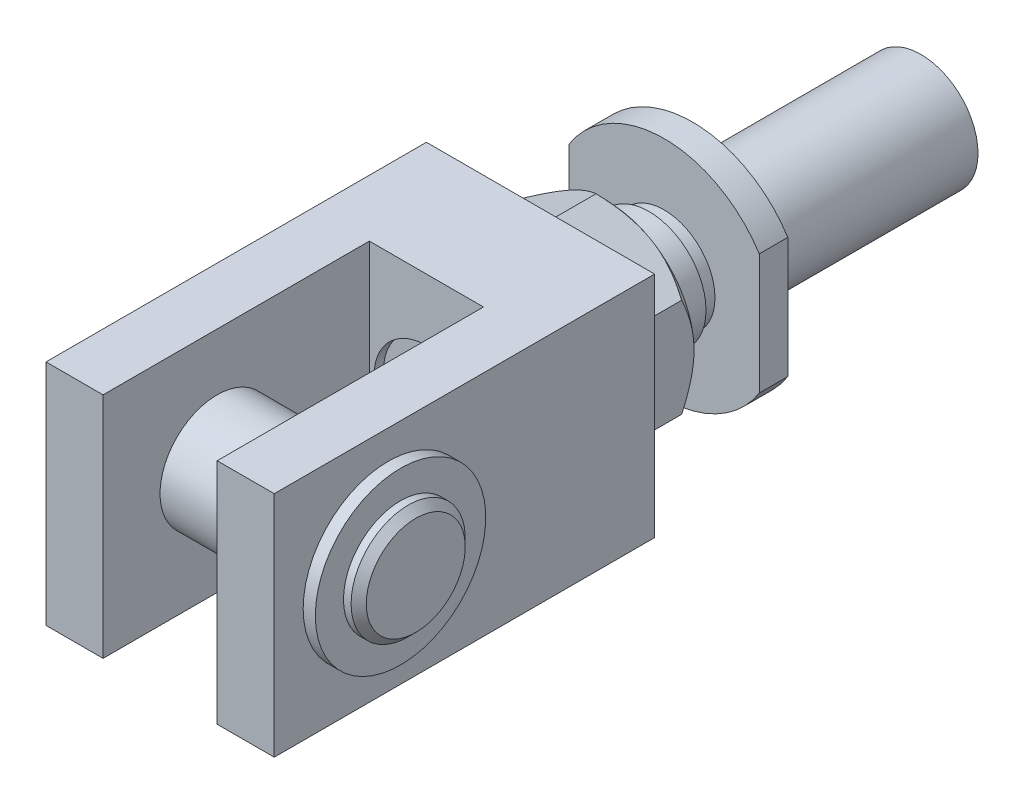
ISO-10303-21;
HEADER;
FILE_DESCRIPTION(('STEP AP214'),'2;1');
FILE_NAME('part.step','',(''),(''),'','','');
FILE_SCHEMA(('AUTOMOTIVE_DESIGN { 1 0 10303 214 1 1 1 1 }'));
ENDSEC;
DATA;
#1=APPLICATION_CONTEXT('core data for automotive mechanical design processes');
#2=APPLICATION_PROTOCOL_DEFINITION('international standard','automotive_design',2000,#1);
#3=PRODUCT_CONTEXT('',#1,'mechanical');
#4=PRODUCT('Part','Part','',(#3));
#5=PRODUCT_RELATED_PRODUCT_CATEGORY('part','',(#4));
#6=PRODUCT_DEFINITION_FORMATION('','',#4);
#7=PRODUCT_DEFINITION_CONTEXT('part definition',#1,'design');
#8=PRODUCT_DEFINITION('design','',#6,#7);
#9=PRODUCT_DEFINITION_SHAPE('','',#8);
#10=(LENGTH_UNIT() NAMED_UNIT(*) SI_UNIT(.MILLI.,.METRE.));
#11=(NAMED_UNIT(*) PLANE_ANGLE_UNIT() SI_UNIT($,.RADIAN.));
#12=(NAMED_UNIT(*) SI_UNIT($,.STERADIAN.) SOLID_ANGLE_UNIT());
#13=UNCERTAINTY_MEASURE_WITH_UNIT(LENGTH_MEASURE(1.E-05),#10,'distance_accuracy_value','');
#14=(GEOMETRIC_REPRESENTATION_CONTEXT(3) GLOBAL_UNCERTAINTY_ASSIGNED_CONTEXT((#13)) GLOBAL_UNIT_ASSIGNED_CONTEXT((#10,
#11,#12)) REPRESENTATION_CONTEXT('',''));
#15=CARTESIAN_POINT('',(0.,0.,0.));
#16=DIRECTION('',(0.,0.,1.));
#17=DIRECTION('',(1.,0.,0.));
#18=AXIS2_PLACEMENT_3D('',#15,#16,#17);
#19=CARTESIAN_POINT('',(23.622,0.,44.45));
#20=DIRECTION('',(1.,0.,0.));
#21=DIRECTION('',(0.,0.,1.));
#22=AXIS2_PLACEMENT_3D('',#19,#20,#21);
#23=PLANE('',#22);
#24=CARTESIAN_POINT('',(23.622,0.,44.45));
#25=DIRECTION('',(1.,0.,0.));
#26=DIRECTION('',(0.,0.,1.));
#27=AXIS2_PLACEMENT_3D('',#24,#25,#26);
#28=CIRCLE('',#27,8.255);
#29=CARTESIAN_POINT('',(23.622,0.,52.705));
#30=VERTEX_POINT('',#29);
#31=EDGE_CURVE('E623',#30,#30,#28,.T.);
#32=ORIENTED_EDGE('',*,*,#31,.T.);
#33=EDGE_LOOP('',(#32));
#34=FACE_BOUND('',#33,.T.);
#35=ADVANCED_FACE('F15',(#34),#23,.T.);
#36=CARTESIAN_POINT('',(23.622,0.,44.45));
#37=DIRECTION('',(-1.,0.,0.));
#38=DIRECTION('',(0.,0.,-1.));
#39=AXIS2_PLACEMENT_3D('',#36,#37,#38);
#40=CONICAL_SURFACE('',#39,8.255,0.785398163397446);
#41=CARTESIAN_POINT('',(22.352,0.,44.45));
#42=DIRECTION('',(1.,0.,0.));
#43=DIRECTION('',(0.,0.,1.));
#44=AXIS2_PLACEMENT_3D('',#41,#42,#43);
#45=CIRCLE('',#44,9.525);
#46=CARTESIAN_POINT('',(22.352,0.,53.975));
#47=VERTEX_POINT('',#46);
#48=EDGE_CURVE('E625',#47,#47,#45,.F.);
#49=ORIENTED_EDGE('',*,*,#48,.F.);
#50=EDGE_LOOP('',(#49));
#51=FACE_BOUND('',#50,.T.);
#52=ORIENTED_EDGE('',*,*,#31,.F.);
#53=EDGE_LOOP('',(#52));
#54=FACE_BOUND('',#53,.T.);
#55=ADVANCED_FACE('F363',(#51,#54),#40,.T.);
#56=CARTESIAN_POINT('',(23.622,0.,44.45));
#57=DIRECTION('',(-1.,0.,0.));
#58=DIRECTION('',(0.,0.,-1.));
#59=AXIS2_PLACEMENT_3D('',#56,#57,#58);
#60=CYLINDRICAL_SURFACE('',#59,9.525);
#61=ORIENTED_EDGE('',*,*,#48,.T.);
#62=EDGE_LOOP('',(#61));
#63=FACE_BOUND('',#62,.T.);
#64=CARTESIAN_POINT('',(21.082,0.,44.45));
#65=DIRECTION('',(1.,0.,0.));
#66=DIRECTION('',(0.,0.,1.));
#67=AXIS2_PLACEMENT_3D('',#64,#65,#66);
#68=CIRCLE('',#67,9.525);
#69=CARTESIAN_POINT('',(21.082,0.,53.975));
#70=VERTEX_POINT('',#69);
#71=EDGE_CURVE('E597',#70,#70,#68,.T.);
#72=ORIENTED_EDGE('',*,*,#71,.T.);
#73=EDGE_LOOP('',(#72));
#74=FACE_BOUND('',#73,.T.);
#75=ADVANCED_FACE('F369',(#63,#74),#60,.T.);
#76=CARTESIAN_POINT('',(21.082,0.,44.45));
#77=DIRECTION('',(1.,0.,0.));
#78=DIRECTION('',(0.,0.,1.));
#79=AXIS2_PLACEMENT_3D('',#76,#77,#78);
#80=PLANE('',#79);
#81=CARTESIAN_POINT('',(21.082,0.,44.45));
#82=DIRECTION('',(1.,0.,0.));
#83=DIRECTION('',(0.,0.,1.));
#84=AXIS2_PLACEMENT_3D('',#81,#82,#83);
#85=CIRCLE('',#84,14.224);
#86=CARTESIAN_POINT('',(21.082,0.,58.674));
#87=VERTEX_POINT('',#86);
#88=EDGE_CURVE('E606',#87,#87,#85,.T.);
#89=ORIENTED_EDGE('',*,*,#88,.T.);
#90=EDGE_LOOP('',(#89));
#91=FACE_BOUND('',#90,.T.);
#92=ORIENTED_EDGE('',*,*,#71,.F.);
#93=EDGE_LOOP('',(#92));
#94=FACE_BOUND('',#93,.T.);
#95=ADVANCED_FACE('F376',(#91,#94),#80,.T.);
#96=CARTESIAN_POINT('',(21.082,0.,44.45));
#97=DIRECTION('',(-1.,0.,0.));
#98=DIRECTION('',(0.,0.,-1.));
#99=AXIS2_PLACEMENT_3D('',#96,#97,#98);
#100=CYLINDRICAL_SURFACE('',#99,14.224);
#101=ORIENTED_EDGE('',*,*,#88,.F.);
#102=EDGE_LOOP('',(#101));
#103=FACE_BOUND('',#102,.T.);
#104=CARTESIAN_POINT('',(19.05,0.,44.45));
#105=DIRECTION('',(1.,0.,0.));
#106=DIRECTION('',(0.,0.,1.));
#107=AXIS2_PLACEMENT_3D('',#104,#105,#106);
#108=CIRCLE('',#107,14.224);
#109=CARTESIAN_POINT('',(19.05,0.,58.674));
#110=VERTEX_POINT('',#109);
#111=EDGE_CURVE('E601',#110,#110,#108,.T.);
#112=ORIENTED_EDGE('',*,*,#111,.T.);
#113=EDGE_LOOP('',(#112));
#114=FACE_BOUND('',#113,.T.);
#115=ADVANCED_FACE('F386',(#103,#114),#100,.T.);
#116=CARTESIAN_POINT('',(19.05,0.,44.45));
#117=DIRECTION('',(-1.,0.,0.));
#118=DIRECTION('',(0.,0.,-1.));
#119=AXIS2_PLACEMENT_3D('',#116,#117,#118);
#120=CYLINDRICAL_SURFACE('',#119,9.525);
#121=CARTESIAN_POINT('',(19.05,0.,44.45));
#122=DIRECTION('',(1.,0.,0.));
#123=DIRECTION('',(0.,0.,1.));
#124=AXIS2_PLACEMENT_3D('',#121,#122,#123);
#125=CIRCLE('',#124,9.525);
#126=CARTESIAN_POINT('',(19.05,0.,53.975));
#127=VERTEX_POINT('',#126);
#128=EDGE_CURVE('E620',#127,#127,#125,.T.);
#129=ORIENTED_EDGE('',*,*,#128,.F.);
#130=EDGE_LOOP('',(#129));
#131=FACE_BOUND('',#130,.T.);
#132=CARTESIAN_POINT('',(-19.05,0.,44.45));
#133=DIRECTION('',(-1.,0.,0.));
#134=DIRECTION('',(0.,0.,-1.));
#135=AXIS2_PLACEMENT_3D('',#132,#133,#134);
#136=CIRCLE('',#135,9.525);
#137=CARTESIAN_POINT('',(-19.05,0.,34.925));
#138=VERTEX_POINT('',#137);
#139=EDGE_CURVE('E617',#138,#138,#136,.T.);
#140=ORIENTED_EDGE('',*,*,#139,.F.);
#141=EDGE_LOOP('',(#140));
#142=FACE_BOUND('',#141,.T.);
#143=ADVANCED_FACE('F382',(#131,#142),#120,.T.);
#144=CARTESIAN_POINT('',(19.05,0.,44.45));
#145=DIRECTION('',(1.,0.,0.));
#146=DIRECTION('',(0.,0.,1.));
#147=AXIS2_PLACEMENT_3D('',#144,#145,#146);
#148=PLANE('',#147);
#149=ORIENTED_EDGE('',*,*,#128,.T.);
#150=EDGE_LOOP('',(#149));
#151=FACE_BOUND('',#150,.T.);
#152=CARTESIAN_POINT('',(19.05,0.,44.45));
#153=DIRECTION('',(1.,0.,0.));
#154=DIRECTION('',(0.,0.,-1.));
#155=AXIS2_PLACEMENT_3D('',#152,#153,#154);
#156=CIRCLE('',#155,9.5377);
#157=CARTESIAN_POINT('',(19.05,0.,34.9123));
#158=VERTEX_POINT('',#157);
#159=EDGE_CURVE('E26',#158,#158,#156,.T.);
#160=ORIENTED_EDGE('',*,*,#159,.F.);
#161=EDGE_LOOP('',(#160));
#162=FACE_BOUND('',#161,.T.);
#163=ADVANCED_FACE('F378',(#151,#162),#148,.F.);
#164=CARTESIAN_POINT('',(-19.05,0.,44.45));
#165=DIRECTION('',(-1.,0.,0.));
#166=DIRECTION('',(0.,0.,-1.));
#167=AXIS2_PLACEMENT_3D('',#164,#165,#166);
#168=PLANE('',#167);
#169=ORIENTED_EDGE('',*,*,#139,.T.);
#170=EDGE_LOOP('',(#169));
#171=FACE_BOUND('',#170,.T.);
#172=CARTESIAN_POINT('',(-19.05,0.,44.45));
#173=DIRECTION('',(-1.,0.,0.));
#174=DIRECTION('',(0.,0.,1.));
#175=AXIS2_PLACEMENT_3D('',#172,#173,#174);
#176=CIRCLE('',#175,9.5377);
#177=CARTESIAN_POINT('',(-19.05,0.,53.9877));
#178=VERTEX_POINT('',#177);
#179=EDGE_CURVE('E9',#178,#178,#176,.T.);
#180=ORIENTED_EDGE('',*,*,#179,.F.);
#181=EDGE_LOOP('',(#180));
#182=FACE_BOUND('',#181,.T.);
#183=ADVANCED_FACE('F381',(#171,#182),#168,.F.);
#184=CARTESIAN_POINT('',(-23.114,0.,44.45));
#185=DIRECTION('',(-1.,0.,0.));
#186=DIRECTION('',(0.,0.,-1.));
#187=AXIS2_PLACEMENT_3D('',#184,#185,#186);
#188=PLANE('',#187);
#189=CARTESIAN_POINT('',(-23.114,0.,44.45));
#190=DIRECTION('',(-1.,0.,0.));
#191=DIRECTION('',(0.,0.,-1.));
#192=AXIS2_PLACEMENT_3D('',#189,#190,#191);
#193=CIRCLE('',#192,11.938);
#194=CARTESIAN_POINT('',(-23.114,0.,32.512));
#195=VERTEX_POINT('',#194);
#196=EDGE_CURVE('E614',#195,#195,#193,.T.);
#197=ORIENTED_EDGE('',*,*,#196,.T.);
#198=EDGE_LOOP('',(#197));
#199=FACE_BOUND('',#198,.T.);
#200=ADVANCED_FACE('F393',(#199),#188,.T.);
#201=CARTESIAN_POINT('',(-23.114,0.,44.45));
#202=DIRECTION('',(1.,0.,0.));
#203=DIRECTION('',(0.,0.,1.));
#204=AXIS2_PLACEMENT_3D('',#201,#202,#203);
#205=CYLINDRICAL_SURFACE('',#204,11.938);
#206=ORIENTED_EDGE('',*,*,#196,.F.);
#207=EDGE_LOOP('',(#206));
#208=FACE_BOUND('',#207,.T.);
#209=CARTESIAN_POINT('',(-19.05,0.,44.45));
#210=DIRECTION('',(-1.,0.,0.));
#211=DIRECTION('',(0.,0.,-1.));
#212=AXIS2_PLACEMENT_3D('',#209,#210,#211);
#213=CIRCLE('',#212,11.938);
#214=CARTESIAN_POINT('',(-19.05,0.,32.512));
#215=VERTEX_POINT('',#214);
#216=EDGE_CURVE('E611',#215,#215,#213,.T.);
#217=ORIENTED_EDGE('',*,*,#216,.T.);
#218=EDGE_LOOP('',(#217));
#219=FACE_BOUND('',#218,.T.);
#220=ADVANCED_FACE('F397',(#208,#219),#205,.T.);
#221=CARTESIAN_POINT('',(0.,9.525,-63.5));
#222=DIRECTION('',(0.,0.,1.));
#223=DIRECTION('',(1.,0.,0.));
#224=AXIS2_PLACEMENT_3D('',#221,#222,#223);
#225=PLANE('',#224);
#226=CARTESIAN_POINT('',(0.,0.,-63.5));
#227=DIRECTION('',(0.,0.,1.));
#228=DIRECTION('',(1.,0.,0.));
#229=AXIS2_PLACEMENT_3D('',#226,#227,#228);
#230=CIRCLE('',#229,9.525);
#231=CARTESIAN_POINT('',(9.525,0.,-63.5));
#232=VERTEX_POINT('',#231);
#233=EDGE_CURVE('E577',#232,#232,#230,.T.);
#234=ORIENTED_EDGE('',*,*,#233,.F.);
#235=EDGE_LOOP('',(#234));
#236=FACE_BOUND('',#235,.T.);
#237=ADVANCED_FACE('F401',(#236),#225,.F.);
#238=CARTESIAN_POINT('',(0.,0.,28.1915148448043));
#239=DIRECTION('',(0.,0.,1.));
#240=DIRECTION('',(1.,0.,0.));
#241=AXIS2_PLACEMENT_3D('',#238,#239,#240);
#242=CYLINDRICAL_SURFACE('',#241,9.525);
#243=CARTESIAN_POINT('',(0.,0.,-27.94));
#244=DIRECTION('',(0.,0.,-1.));
#245=DIRECTION('',(-1.,0.,0.));
#246=AXIS2_PLACEMENT_3D('',#243,#244,#245);
#247=CIRCLE('',#246,9.525);
#248=CARTESIAN_POINT('',(-9.525,0.,-27.94));
#249=VERTEX_POINT('',#248);
#250=EDGE_CURVE('E545',#249,#249,#247,.T.);
#251=ORIENTED_EDGE('',*,*,#250,.T.);
#252=EDGE_LOOP('',(#251));
#253=FACE_BOUND('',#252,.T.);
#254=ORIENTED_EDGE('',*,*,#233,.T.);
#255=EDGE_LOOP('',(#254));
#256=FACE_BOUND('',#255,.T.);
#257=ADVANCED_FACE('F466',(#253,#256),#242,.T.);
#258=CARTESIAN_POINT('',(0.,0.,-27.94));
#259=DIRECTION('',(0.,0.,-1.));
#260=DIRECTION('',(-1.,0.,0.));
#261=AXIS2_PLACEMENT_3D('',#258,#259,#260);
#262=PLANE('',#261);
#263=ORIENTED_EDGE('',*,*,#250,.F.);
#264=EDGE_LOOP('',(#263));
#265=FACE_BOUND('',#264,.T.);
#266=CARTESIAN_POINT('',(0.,0.,-27.94));
#267=DIRECTION('',(0.,0.,-1.));
#268=DIRECTION('',(-1.,0.,0.));
#269=AXIS2_PLACEMENT_3D('',#266,#267,#268);
#270=CIRCLE('',#269,8.4836);
#271=CARTESIAN_POINT('',(-8.4836,0.,-27.94));
#272=VERTEX_POINT('',#271);
#273=EDGE_CURVE('E167',#272,#272,#270,.T.);
#274=ORIENTED_EDGE('',*,*,#273,.T.);
#275=EDGE_LOOP('',(#274));
#276=FACE_BOUND('',#275,.T.);
#277=ADVANCED_FACE('F462',(#265,#276),#262,.F.);
#278=CARTESIAN_POINT('',(0.,0.,-27.94));
#279=DIRECTION('',(0.,0.,1.));
#280=DIRECTION('',(1.,0.,0.));
#281=AXIS2_PLACEMENT_3D('',#278,#279,#280);
#282=CYLINDRICAL_SURFACE('',#281,8.4836);
#283=ORIENTED_EDGE('',*,*,#273,.F.);
#284=EDGE_LOOP('',(#283));
#285=FACE_BOUND('',#284,.T.);
#286=CARTESIAN_POINT('',(0.,0.,-25.4));
#287=DIRECTION('',(0.,0.,-1.));
#288=DIRECTION('',(-1.,0.,0.));
#289=AXIS2_PLACEMENT_3D('',#286,#287,#288);
#290=CIRCLE('',#289,8.4836);
#291=CARTESIAN_POINT('',(-8.4836,0.,-25.4));
#292=VERTEX_POINT('',#291);
#293=EDGE_CURVE('E159',#292,#292,#290,.T.);
#294=ORIENTED_EDGE('',*,*,#293,.T.);
#295=EDGE_LOOP('',(#294));
#296=FACE_BOUND('',#295,.T.);
#297=ADVANCED_FACE('F458',(#285,#296),#282,.T.);
#298=CARTESIAN_POINT('',(0.,18.796,-25.4));
#299=DIRECTION('',(0.,0.,1.));
#300=DIRECTION('',(1.,0.,0.));
#301=AXIS2_PLACEMENT_3D('',#298,#299,#300);
#302=PLANE('',#301);
#303=CARTESIAN_POINT('',(0.,0.,-25.4));
#304=DIRECTION('',(0.,0.,1.));
#305=DIRECTION('',(1.,0.,0.));
#306=AXIS2_PLACEMENT_3D('',#303,#304,#305);
#307=CIRCLE('',#306,18.796);
#308=CARTESIAN_POINT('',(15.875,10.063497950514,-25.4));
#309=VERTEX_POINT('',#308);
#310=CARTESIAN_POINT('',(-15.875,10.063497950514,-25.4));
#311=VERTEX_POINT('',#310);
#312=EDGE_CURVE('E580',#309,#311,#307,.T.);
#313=ORIENTED_EDGE('',*,*,#312,.F.);
#314=DIRECTION('',(0.,1.,0.));
#315=VECTOR('',#314,1.);
#316=CARTESIAN_POINT('',(15.875,10.063497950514,-25.4));
#317=LINE('',#316,#315);
#318=CARTESIAN_POINT('',(15.875,-10.063497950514,-25.4));
#319=VERTEX_POINT('',#318);
#320=EDGE_CURVE('E564',#319,#309,#317,.T.);
#321=ORIENTED_EDGE('',*,*,#320,.F.);
#322=CARTESIAN_POINT('',(-15.875,-10.063497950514,-25.4));
#323=VERTEX_POINT('',#322);
#324=EDGE_CURVE('E581',#323,#319,#307,.T.);
#325=ORIENTED_EDGE('',*,*,#324,.F.);
#326=DIRECTION('',(0.,-1.,0.));
#327=VECTOR('',#326,1.);
#328=CARTESIAN_POINT('',(-15.875,10.063497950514,-25.4));
#329=LINE('',#328,#327);
#330=EDGE_CURVE('E574',#311,#323,#329,.T.);
#331=ORIENTED_EDGE('',*,*,#330,.F.);
#332=EDGE_LOOP('',(#313,#321,#325,#331));
#333=FACE_BOUND('',#332,.T.);
#334=ORIENTED_EDGE('',*,*,#293,.F.);
#335=EDGE_LOOP('',(#334));
#336=FACE_BOUND('',#335,.T.);
#337=ADVANCED_FACE('F461',(#333,#336),#302,.F.);
#338=CARTESIAN_POINT('',(-15.875,10.063497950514,-63.501));
#339=DIRECTION('',(1.,0.,0.));
#340=DIRECTION('',(0.,1.,0.));
#341=AXIS2_PLACEMENT_3D('',#338,#339,#340);
#342=PLANE('',#341);
#343=ORIENTED_EDGE('',*,*,#330,.T.);
#344=DIRECTION('',(0.,0.,1.));
#345=VECTOR('',#344,1.);
#346=CARTESIAN_POINT('',(-15.875,-10.063497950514,-63.501));
#347=LINE('',#346,#345);
#348=CARTESIAN_POINT('',(-15.875,-10.063497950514,-20.6375));
#349=VERTEX_POINT('',#348);
#350=EDGE_CURVE('E570',#323,#349,#347,.T.);
#351=ORIENTED_EDGE('',*,*,#350,.T.);
#352=DIRECTION('',(0.,1.,0.));
#353=VECTOR('',#352,1.);
#354=CARTESIAN_POINT('',(-15.875,10.063497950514,-20.6375));
#355=LINE('',#354,#353);
#356=CARTESIAN_POINT('',(-15.875,10.063497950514,-20.6375));
#357=VERTEX_POINT('',#356);
#358=EDGE_CURVE('E567',#349,#357,#355,.T.);
#359=ORIENTED_EDGE('',*,*,#358,.T.);
#360=DIRECTION('',(0.,0.,1.));
#361=VECTOR('',#360,1.);
#362=CARTESIAN_POINT('',(-15.875,10.063497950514,-63.501));
#363=LINE('',#362,#361);
#364=EDGE_CURVE('E571',#311,#357,#363,.T.);
#365=ORIENTED_EDGE('',*,*,#364,.F.);
#366=EDGE_LOOP('',(#343,#351,#359,#365));
#367=FACE_BOUND('',#366,.T.);
#368=ADVANCED_FACE('F484',(#367),#342,.F.);
#369=CARTESIAN_POINT('',(0.,0.,28.1915148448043));
#370=DIRECTION('',(0.,0.,1.));
#371=DIRECTION('',(1.,0.,0.));
#372=AXIS2_PLACEMENT_3D('',#369,#370,#371);
#373=CYLINDRICAL_SURFACE('',#372,18.796);
#374=CARTESIAN_POINT('',(0.,0.,-20.6375));
#375=DIRECTION('',(0.,0.,1.));
#376=DIRECTION('',(1.,0.,0.));
#377=AXIS2_PLACEMENT_3D('',#374,#375,#376);
#378=CIRCLE('',#377,18.796);
#379=CARTESIAN_POINT('',(15.875,10.063497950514,-20.6375));
#380=VERTEX_POINT('',#379);
#381=EDGE_CURVE('E584',#380,#357,#378,.T.);
#382=ORIENTED_EDGE('',*,*,#381,.F.);
#383=DIRECTION('',(0.,0.,1.));
#384=VECTOR('',#383,1.);
#385=CARTESIAN_POINT('',(15.875,10.063497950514,-63.501));
#386=LINE('',#385,#384);
#387=EDGE_CURVE('E560',#309,#380,#386,.T.);
#388=ORIENTED_EDGE('',*,*,#387,.F.);
#389=ORIENTED_EDGE('',*,*,#312,.T.);
#390=ORIENTED_EDGE('',*,*,#364,.T.);
#391=EDGE_LOOP('',(#382,#388,#389,#390));
#392=FACE_BOUND('',#391,.T.);
#393=ADVANCED_FACE('F482',(#392),#373,.T.);
#394=CARTESIAN_POINT('',(15.875,10.063497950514,-63.501));
#395=DIRECTION('',(-1.,0.,0.));
#396=DIRECTION('',(0.,-1.,0.));
#397=AXIS2_PLACEMENT_3D('',#394,#395,#396);
#398=PLANE('',#397);
#399=ORIENTED_EDGE('',*,*,#320,.T.);
#400=ORIENTED_EDGE('',*,*,#387,.T.);
#401=DIRECTION('',(0.,-1.,0.));
#402=VECTOR('',#401,1.);
#403=CARTESIAN_POINT('',(15.875,10.063497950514,-20.6375));
#404=LINE('',#403,#402);
#405=CARTESIAN_POINT('',(15.875,-10.063497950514,-20.6375));
#406=VERTEX_POINT('',#405);
#407=EDGE_CURVE('E558',#380,#406,#404,.T.);
#408=ORIENTED_EDGE('',*,*,#407,.T.);
#409=DIRECTION('',(0.,0.,1.));
#410=VECTOR('',#409,1.);
#411=CARTESIAN_POINT('',(15.875,-10.063497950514,-63.501));
#412=LINE('',#411,#410);
#413=EDGE_CURVE('E561',#319,#406,#412,.T.);
#414=ORIENTED_EDGE('',*,*,#413,.F.);
#415=EDGE_LOOP('',(#399,#400,#408,#414));
#416=FACE_BOUND('',#415,.T.);
#417=ADVANCED_FACE('F478',(#416),#398,.F.);
#418=ORIENTED_EDGE('',*,*,#324,.T.);
#419=ORIENTED_EDGE('',*,*,#413,.T.);
#420=EDGE_CURVE('E585',#349,#406,#378,.T.);
#421=ORIENTED_EDGE('',*,*,#420,.F.);
#422=ORIENTED_EDGE('',*,*,#350,.F.);
#423=EDGE_LOOP('',(#418,#419,#421,#422));
#424=FACE_BOUND('',#423,.T.);
#425=ADVANCED_FACE('F481',(#424),#373,.T.);
#426=CARTESIAN_POINT('',(0.,9.525,-20.6375));
#427=DIRECTION('',(0.,0.,-1.));
#428=DIRECTION('',(-1.,0.,0.));
#429=AXIS2_PLACEMENT_3D('',#426,#427,#428);
#430=PLANE('',#429);
#431=ORIENTED_EDGE('',*,*,#420,.T.);
#432=ORIENTED_EDGE('',*,*,#407,.F.);
#433=ORIENTED_EDGE('',*,*,#381,.T.);
#434=ORIENTED_EDGE('',*,*,#358,.F.);
#435=EDGE_LOOP('',(#431,#432,#433,#434));
#436=FACE_BOUND('',#435,.T.);
#437=CARTESIAN_POINT('',(0.,0.,-20.6375));
#438=DIRECTION('',(0.,0.,1.));
#439=DIRECTION('',(1.,0.,0.));
#440=AXIS2_PLACEMENT_3D('',#437,#438,#439);
#441=CIRCLE('',#440,8.4836);
#442=CARTESIAN_POINT('',(8.4836,0.,-20.6375));
#443=VERTEX_POINT('',#442);
#444=EDGE_CURVE('E549',#443,#443,#441,.T.);
#445=ORIENTED_EDGE('',*,*,#444,.F.);
#446=EDGE_LOOP('',(#445));
#447=FACE_BOUND('',#446,.T.);
#448=ADVANCED_FACE('F472',(#436,#447),#430,.F.);
#449=CARTESIAN_POINT('',(0.,0.,-18.0975));
#450=DIRECTION('',(0.,0.,-1.));
#451=DIRECTION('',(-1.,0.,0.));
#452=AXIS2_PLACEMENT_3D('',#449,#450,#451);
#453=CYLINDRICAL_SURFACE('',#452,8.4836);
#454=CARTESIAN_POINT('',(0.,0.,-18.0975));
#455=DIRECTION('',(0.,0.,1.));
#456=DIRECTION('',(1.,0.,0.));
#457=AXIS2_PLACEMENT_3D('',#454,#455,#456);
#458=CIRCLE('',#457,8.4836);
#459=CARTESIAN_POINT('',(8.4836,0.,-18.0975));
#460=VERTEX_POINT('',#459);
#461=EDGE_CURVE('E550',#460,#460,#458,.T.);
#462=ORIENTED_EDGE('',*,*,#461,.F.);
#463=EDGE_LOOP('',(#462));
#464=FACE_BOUND('',#463,.T.);
#465=ORIENTED_EDGE('',*,*,#444,.T.);
#466=EDGE_LOOP('',(#465));
#467=FACE_BOUND('',#466,.T.);
#468=ADVANCED_FACE('F468',(#464,#467),#453,.T.);
#469=CARTESIAN_POINT('',(0.,0.,-18.0975));
#470=DIRECTION('',(0.,0.,1.));
#471=DIRECTION('',(1.,0.,0.));
#472=AXIS2_PLACEMENT_3D('',#469,#470,#471);
#473=PLANE('',#472);
#474=CARTESIAN_POINT('',(0.,0.,-18.0975));
#475=DIRECTION('',(0.,0.,1.));
#476=DIRECTION('',(1.,0.,0.));
#477=AXIS2_PLACEMENT_3D('',#474,#475,#476);
#478=CIRCLE('',#477,9.525);
#479=CARTESIAN_POINT('',(9.525,0.,-18.0975));
#480=VERTEX_POINT('',#479);
#481=EDGE_CURVE('E553',#480,#480,#478,.T.);
#482=ORIENTED_EDGE('',*,*,#481,.F.);
#483=EDGE_LOOP('',(#482));
#484=FACE_BOUND('',#483,.T.);
#485=ORIENTED_EDGE('',*,*,#461,.T.);
#486=EDGE_LOOP('',(#485));
#487=FACE_BOUND('',#486,.T.);
#488=ADVANCED_FACE('F471',(#484,#487),#473,.F.);
#489=CARTESIAN_POINT('',(0.,0.,28.1915148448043));
#490=DIRECTION('',(0.,0.,1.));
#491=DIRECTION('',(1.,0.,0.));
#492=AXIS2_PLACEMENT_3D('',#489,#490,#491);
#493=CYLINDRICAL_SURFACE('',#492,9.525);
#494=CARTESIAN_POINT('',(0.,0.,-10.747210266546));
#495=DIRECTION('',(0.,0.,-1.));
#496=DIRECTION('',(-1.,0.,0.));
#497=AXIS2_PLACEMENT_3D('',#494,#495,#496);
#498=CIRCLE('',#497,9.525);
#499=CARTESIAN_POINT('',(-9.525,0.,-10.747210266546));
#500=VERTEX_POINT('',#499);
#501=EDGE_CURVE('E588',#500,#500,#498,.T.);
#502=ORIENTED_EDGE('',*,*,#501,.T.);
#503=EDGE_LOOP('',(#502));
#504=FACE_BOUND('',#503,.T.);
#505=ORIENTED_EDGE('',*,*,#481,.T.);
#506=EDGE_LOOP('',(#505));
#507=FACE_BOUND('',#506,.T.);
#508=ADVANCED_FACE('F476',(#504,#507),#493,.T.);
#509=CARTESIAN_POINT('',(0.,0.,-11.303));
#510=DIRECTION('',(0.,0.,-1.));
#511=DIRECTION('',(-1.,0.,0.));
#512=AXIS2_PLACEMENT_3D('',#509,#510,#511);
#513=CONICAL_SURFACE('',#512,10.31875,0.95993108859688);
#514=CARTESIAN_POINT('',(0.,0.,-11.303));
#515=DIRECTION('',(0.,0.,1.));
#516=DIRECTION('',(1.,0.,0.));
#517=AXIS2_PLACEMENT_3D('',#514,#515,#516);
#518=CIRCLE('',#517,10.31875);
#519=CARTESIAN_POINT('',(10.31875,0.,-11.303));
#520=VERTEX_POINT('',#519);
#521=EDGE_CURVE('E595',#520,#520,#518,.T.);
#522=ORIENTED_EDGE('',*,*,#521,.F.);
#523=EDGE_LOOP('',(#522));
#524=FACE_BOUND('',#523,.T.);
#525=ORIENTED_EDGE('',*,*,#501,.F.);
#526=EDGE_LOOP('',(#525));
#527=FACE_BOUND('',#526,.T.);
#528=ADVANCED_FACE('F505',(#524,#527),#513,.F.);
#529=CARTESIAN_POINT('',(0.,0.,-25.0375057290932));
#530=DIRECTION('',(0.,0.,1.));
#531=DIRECTION('',(1.,0.,0.));
#532=AXIS2_PLACEMENT_3D('',#529,#530,#531);
#533=CYLINDRICAL_SURFACE('',#532,10.31875);
#534=ORIENTED_EDGE('',*,*,#521,.T.);
#535=EDGE_LOOP('',(#534));
#536=FACE_BOUND('',#535,.T.);
#537=CARTESIAN_POINT('',(0.,0.,-11.3284));
#538=DIRECTION('',(0.,0.,1.));
#539=DIRECTION('',(1.,0.,0.));
#540=AXIS2_PLACEMENT_3D('',#537,#538,#539);
#541=CIRCLE('',#540,10.31875);
#542=CARTESIAN_POINT('',(10.31875,0.,-11.3284));
#543=VERTEX_POINT('',#542);
#544=EDGE_CURVE('E20',#543,#543,#541,.F.);
#545=ORIENTED_EDGE('',*,*,#544,.T.);
#546=EDGE_LOOP('',(#545));
#547=FACE_BOUND('',#546,.T.);
#548=ADVANCED_FACE('F406',(#536,#547),#533,.F.);
#549=CARTESIAN_POINT('',(-28.575,0.,-11.3284));
#550=DIRECTION('',(0.,0.,1.));
#551=DIRECTION('',(1.,0.,0.));
#552=AXIS2_PLACEMENT_3D('',#549,#550,#551);
#553=PLANE('',#552);
#554=CARTESIAN_POINT('',(0.,0.,-11.3284));
#555=DIRECTION('',(0.,0.,1.));
#556=DIRECTION('',(1.,0.,0.));
#557=AXIS2_PLACEMENT_3D('',#554,#555,#556);
#558=CIRCLE('',#557,14.2875);
#559=CARTESIAN_POINT('',(14.2875,0.,-11.3284));
#560=VERTEX_POINT('',#559);
#561=CARTESIAN_POINT('',(7.14375,12.3733379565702,-11.3284));
#562=VERTEX_POINT('',#561);
#563=EDGE_CURVE('E273',#560,#562,#558,.T.);
#564=ORIENTED_EDGE('',*,*,#563,.F.);
#565=CARTESIAN_POINT('',(0.,0.,-11.3284));
#566=DIRECTION('',(0.,0.,1.));
#567=DIRECTION('',(1.,0.,0.));
#568=AXIS2_PLACEMENT_3D('',#565,#566,#567);
#569=CIRCLE('',#568,14.2875);
#570=CARTESIAN_POINT('',(7.14375,-12.3733379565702,-11.3284));
#571=VERTEX_POINT('',#570);
#572=EDGE_CURVE('E117',#560,#571,#569,.F.);
#573=ORIENTED_EDGE('',*,*,#572,.T.);
#574=CARTESIAN_POINT('',(-7.14375,-12.3733379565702,-11.3284));
#575=VERTEX_POINT('',#574);
#576=EDGE_CURVE('E160',#571,#575,#569,.F.);
#577=ORIENTED_EDGE('',*,*,#576,.T.);
#578=CARTESIAN_POINT('',(-14.2875,0.,-11.3284));
#579=VERTEX_POINT('',#578);
#580=EDGE_CURVE('E169',#575,#579,#569,.F.);
#581=ORIENTED_EDGE('',*,*,#580,.T.);
#582=CARTESIAN_POINT('',(-7.14375,12.3733379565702,-11.3284));
#583=VERTEX_POINT('',#582);
#584=EDGE_CURVE('E171',#579,#583,#569,.F.);
#585=ORIENTED_EDGE('',*,*,#584,.T.);
#586=EDGE_CURVE('E161',#583,#562,#569,.F.);
#587=ORIENTED_EDGE('',*,*,#586,.T.);
#588=EDGE_LOOP('',(#564,#573,#577,#581,#585,#587));
#589=FACE_BOUND('',#588,.T.);
#590=ORIENTED_EDGE('',*,*,#544,.F.);
#591=EDGE_LOOP('',(#590));
#592=FACE_BOUND('',#591,.T.);
#593=ADVANCED_FACE('F279',(#589,#592),#553,.F.);
#594=CARTESIAN_POINT('',(0.,0.,-11.3284));
#595=DIRECTION('',(0.,0.,1.));
#596=DIRECTION('',(1.,0.,0.));
#597=AXIS2_PLACEMENT_3D('',#594,#595,#596);
#598=CONICAL_SURFACE('',#597,14.2875,0.819669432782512);
#599=CARTESIAN_POINT('',(0.000200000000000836,-16.4978994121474,-9.26454218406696));
#600=CARTESIAN_POINT('',(-0.260725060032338,-16.3472542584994,-9.40517874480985));
#601=CARTESIAN_POINT('',(-0.523597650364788,-16.1954846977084,-9.54113355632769));
#602=CARTESIAN_POINT('',(-1.05352290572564,-15.8895322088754,-9.80218148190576));
#603=CARTESIAN_POINT('',(-1.3205778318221,-15.7353479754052,-9.92726846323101));
#604=CARTESIAN_POINT('',(-1.86032111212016,-15.4237270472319,-10.1655661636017));
#605=CARTESIAN_POINT('',(-2.13303217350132,-15.2662772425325,-10.2787087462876));
#606=CARTESIAN_POINT('',(-2.68261417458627,-14.9489759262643,-10.4905154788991));
#607=CARTESIAN_POINT('',(-2.95948445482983,-14.7891247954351,-10.5891818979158));
#608=CARTESIAN_POINT('',(-3.51232220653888,-14.4699437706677,-10.7685842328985));
#609=CARTESIAN_POINT('',(-3.78821994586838,-14.310654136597,-10.849604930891));
#610=CARTESIAN_POINT('',(-4.34347200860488,-13.9900792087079,-10.9941135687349));
#611=CARTESIAN_POINT('',(-4.6228264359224,-13.8287938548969,-11.057600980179));
#612=CARTESIAN_POINT('',(-5.18368370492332,-13.5049827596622,-11.1653261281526));
#613=CARTESIAN_POINT('',(-5.46518035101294,-13.3424605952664,-11.209606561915));
#614=CARTESIAN_POINT('',(-6.03001257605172,-13.0163545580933,-11.2778836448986));
#615=CARTESIAN_POINT('',(-6.3133480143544,-12.8527707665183,-11.3018818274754));
#616=CARTESIAN_POINT('',(-6.84457480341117,-12.5460668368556,-11.3271660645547));
#617=CARTESIAN_POINT('',(-7.09237848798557,-12.4029973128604,-11.3309581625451));
#618=CARTESIAN_POINT('',(-7.58777426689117,-12.1169804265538,-11.3224835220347));
#619=CARTESIAN_POINT('',(-7.83536636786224,-11.974033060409,-11.3102173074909));
#620=CARTESIAN_POINT('',(-8.32974432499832,-11.688603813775,-11.2698961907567));
#621=CARTESIAN_POINT('',(-8.57652952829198,-11.5461223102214,-11.2418306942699));
#622=CARTESIAN_POINT('',(-9.06844332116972,-11.2621157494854,-11.1705296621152));
#623=CARTESIAN_POINT('',(-9.31357188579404,-11.1205907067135,-11.1272938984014));
#624=CARTESIAN_POINT('',(-9.80175639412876,-10.8387372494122,-11.0265146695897));
#625=CARTESIAN_POINT('',(-10.0448109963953,-10.6984096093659,-10.9689625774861));
#626=CARTESIAN_POINT('',(-10.5283023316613,-10.4192657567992,-10.8406376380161));
#627=CARTESIAN_POINT('',(-10.7687386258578,-10.2804497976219,-10.76986260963));
#628=CARTESIAN_POINT('',(-11.4854668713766,-9.86664655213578,-10.5395145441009));
#629=CARTESIAN_POINT('',(-11.9574578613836,-9.59414242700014,-10.3618583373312));
#630=CARTESIAN_POINT('',(-12.7401729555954,-9.14224165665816,-10.0307041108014));
#631=CARTESIAN_POINT('',(-13.054297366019,-8.96088184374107,-9.88758674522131));
#632=CARTESIAN_POINT('',(-13.675704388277,-8.6021123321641,-9.58657546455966));
#633=CARTESIAN_POINT('',(-13.9830096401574,-8.4246895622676,-9.42874405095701));
#634=CARTESIAN_POINT('',(-14.2877,-8.24877650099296,-9.26454218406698));
#635=B_SPLINE_CURVE_WITH_KNOTS('',3,(#599,#600,#601,#602,#603,#604,#605,#606,#607,#608,#609,
#610,#611,#612,#613,#614,#615,#616,#617,#618,#619,#620,#621,#622,#623,#624,#625,#626,#627,#628,
#629,#630,#631,#632,#633,#634),.UNSPECIFIED.,.F.,.F.,(4,2,2,2,2,2,2,2,2,2,2,2,2,2,2,2,2,4),(0.,
0.997537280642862,1.99563386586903,2.99914710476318,4.002502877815,4.98821568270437,
5.97395819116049,6.95749801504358,7.94096347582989,8.79901530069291,9.65703912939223,
10.5156389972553,11.374251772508,12.2333832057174,13.0926564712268,14.8102210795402,
15.979716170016,17.1444521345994),.UNSPECIFIED.);
#636=CARTESIAN_POINT('',(-14.2875,-8.2488919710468,-9.26465));
#637=VERTEX_POINT('',#636);
#638=EDGE_CURVE('E338',#575,#637,#635,.T.);
#639=ORIENTED_EDGE('',*,*,#638,.T.);
#640=CARTESIAN_POINT('',(-14.2875,-20.0701142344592,-1.66578585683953));
#641=CARTESIAN_POINT('',(-14.2875,-19.8107251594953,-1.86308644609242));
#642=CARTESIAN_POINT('',(-14.2875,-19.5507203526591,-2.05957728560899));
#643=CARTESIAN_POINT('',(-14.2875,-19.0293571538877,-2.45076288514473));
#644=CARTESIAN_POINT('',(-14.2875,-18.7679987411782,-2.64545761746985));
#645=CARTESIAN_POINT('',(-14.2875,-17.9815926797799,-3.22666920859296));
#646=CARTESIAN_POINT('',(-14.2875,-17.4543419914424,-3.61021599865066));
#647=CARTESIAN_POINT('',(-14.2875,-16.3871755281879,-4.3715897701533));
#648=CARTESIAN_POINT('',(-14.2875,-15.8471846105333,-4.74931172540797));
#649=CARTESIAN_POINT('',(-14.2875,-14.7586837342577,-5.49219453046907));
#650=CARTESIAN_POINT('',(-14.2875,-14.210174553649,-5.85735651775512));
#651=CARTESIAN_POINT('',(-14.2875,-13.0594482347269,-6.59977321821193));
#652=CARTESIAN_POINT('',(-14.2875,-12.4563892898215,-6.97573507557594));
#653=CARTESIAN_POINT('',(-14.2875,-11.5407604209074,-7.5213856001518));
#654=CARTESIAN_POINT('',(-14.2875,-11.2336524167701,-7.70025204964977));
#655=CARTESIAN_POINT('',(-14.2875,-10.615412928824,-8.05088363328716));
#656=CARTESIAN_POINT('',(-14.2875,-10.304281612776,-8.22264906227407));
#657=CARTESIAN_POINT('',(-14.2875,-9.67898470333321,-8.55722795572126));
#658=CARTESIAN_POINT('',(-14.2875,-9.36483839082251,-8.72007736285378));
#659=CARTESIAN_POINT('',(-14.2875,-8.73179023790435,-9.03632521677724));
#660=CARTESIAN_POINT('',(-14.2875,-8.41288818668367,-9.18972324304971));
#661=CARTESIAN_POINT('',(-14.2875,-7.77022528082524,-9.48542547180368));
#662=CARTESIAN_POINT('',(-14.2875,-7.44646787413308,-9.62773713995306));
#663=CARTESIAN_POINT('',(-14.2875,-6.79364967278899,-9.89960663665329));
#664=CARTESIAN_POINT('',(-14.2875,-6.46458941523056,-10.0291657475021));
#665=CARTESIAN_POINT('',(-14.2875,-5.8811851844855,-10.2440249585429));
#666=CARTESIAN_POINT('',(-14.2875,-5.62799692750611,-10.3324556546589));
#667=CARTESIAN_POINT('',(-14.2875,-5.11855048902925,-10.4999018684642));
#668=CARTESIAN_POINT('',(-14.2875,-4.8622923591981,-10.5789175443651));
#669=CARTESIAN_POINT('',(-14.2875,-4.0888837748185,-10.8004012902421));
#670=CARTESIAN_POINT('',(-14.2875,-3.56706904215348,-10.9273173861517));
#671=CARTESIAN_POINT('',(-14.2875,-2.78271854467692,-11.0797782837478));
#672=CARTESIAN_POINT('',(-14.2875,-2.52370675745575,-11.1240082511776));
#673=CARTESIAN_POINT('',(-14.2875,-2.00386615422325,-11.1999611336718));
#674=CARTESIAN_POINT('',(-14.2875,-1.74303762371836,-11.2316859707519));
#675=CARTESIAN_POINT('',(-14.2875,-1.22013334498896,-11.2820457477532));
#676=CARTESIAN_POINT('',(-14.2875,-0.958057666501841,-11.300681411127));
#677=CARTESIAN_POINT('',(-14.2875,-0.433293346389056,-11.3245097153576));
#678=CARTESIAN_POINT('',(-14.2875,-0.170604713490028,-11.3297025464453));
#679=CARTESIAN_POINT('',(-14.2875,0.340322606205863,-11.3266302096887));
#680=CARTESIAN_POINT('',(-14.2875,0.588565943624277,-11.3190854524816));
#681=CARTESIAN_POINT('',(-14.2875,1.08442358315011,-11.292025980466));
#682=CARTESIAN_POINT('',(-14.2875,1.33203781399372,-11.2725099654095));
#683=CARTESIAN_POINT('',(-14.2875,1.82605428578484,-11.2218390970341));
#684=CARTESIAN_POINT('',(-14.2875,2.07245660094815,-11.1906849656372));
#685=CARTESIAN_POINT('',(-14.2875,2.56360805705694,-11.1172466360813));
#686=CARTESIAN_POINT('',(-14.2875,2.80835698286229,-11.0749610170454));
#687=CARTESIAN_POINT('',(-14.2875,3.54883533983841,-10.9305112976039));
#688=CARTESIAN_POINT('',(-14.2875,4.04139402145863,-10.8117521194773));
#689=CARTESIAN_POINT('',(-14.2875,5.01567641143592,-10.5369202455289));
#690=CARTESIAN_POINT('',(-14.2875,5.49740115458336,-10.3808511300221));
#691=CARTESIAN_POINT('',(-14.2875,6.55649797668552,-9.99941160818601));
#692=CARTESIAN_POINT('',(-14.2875,7.13108135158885,-9.76634887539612));
#693=CARTESIAN_POINT('',(-14.2875,8.26451975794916,-9.26439986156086));
#694=CARTESIAN_POINT('',(-14.2875,8.82336530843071,-8.99549252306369));
#695=CARTESIAN_POINT('',(-14.2875,9.92888906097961,-8.42919294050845));
#696=CARTESIAN_POINT('',(-14.2875,10.4755153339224,-8.13170018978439));
#697=CARTESIAN_POINT('',(-14.2875,11.5564094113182,-7.51545579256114));
#698=CARTESIAN_POINT('',(-14.2875,12.0906797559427,-7.19670856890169));
#699=CARTESIAN_POINT('',(-14.2875,13.1168584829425,-6.56239889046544));
#700=CARTESIAN_POINT('',(-14.2875,13.6093732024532,-6.24781203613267));
#701=CARTESIAN_POINT('',(-14.2875,14.5867110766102,-5.60686606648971));
#702=CARTESIAN_POINT('',(-14.2875,15.0715336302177,-5.28050603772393));
#703=CARTESIAN_POINT('',(-14.2875,16.0303250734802,-4.62122891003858));
#704=CARTESIAN_POINT('',(-14.2875,16.5043522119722,-4.28839632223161));
#705=CARTESIAN_POINT('',(-14.2875,17.2112134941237,-3.78343826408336));
#706=CARTESIAN_POINT('',(-14.2875,17.446109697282,-3.61418782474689));
#707=CARTESIAN_POINT('',(-14.2875,17.914627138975,-3.27393916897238));
#708=CARTESIAN_POINT('',(-14.2875,18.1482483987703,-3.10294098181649));
#709=CARTESIAN_POINT('',(-14.2875,18.3812855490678,-2.93114993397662));
#710=B_SPLINE_CURVE_WITH_KNOTS('',3,(#640,#641,#642,#643,#644,#645,#646,#647,#648,#649,#650,
#651,#652,#653,#654,#655,#656,#657,#658,#659,#660,#661,#662,#663,#664,#665,#666,#667,#668,#669,
#670,#671,#672,#673,#674,#675,#676,#677,#678,#679,#680,#681,#682,#683,#684,#685,#686,#687,#688,
#689,#690,#691,#692,#693,#694,#695,#696,#697,#698,#699,#700,#701,#702,#703,#704,#705,#706,#707,
#708,#709),.UNSPECIFIED.,.F.,.F.,(4,2,2,2,2,2,2,2,2,2,2,2,2,2,2,2,2,2,2,2,2,2,2,2,2,2,2,2,2,2,2,
2,2,2,4),(0.,0.977694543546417,1.95540413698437,3.91130540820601,5.8881224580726,
7.86476000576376,9.9962098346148,11.0623324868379,12.1284108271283,13.1898156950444,
14.2512677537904,15.3119987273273,16.3726229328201,17.1770036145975,17.9813707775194,
19.5900089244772,20.3780516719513,21.1659732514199,21.9538512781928,22.7417181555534,
23.4865012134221,24.2313651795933,24.9761829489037,25.721095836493,27.239185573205,
28.7571296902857,30.615631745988,32.4752304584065,34.3416250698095,36.2076325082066,
37.9606629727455,39.7138297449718,41.4513505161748,42.3199045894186,43.1884441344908),.UNSPECIFIED.);
#711=EDGE_CURVE('E315',#637,#579,#710,.T.);
#712=ORIENTED_EDGE('',*,*,#711,.T.);
#713=ORIENTED_EDGE('',*,*,#580,.F.);
#714=EDGE_LOOP('',(#639,#712,#713));
#715=FACE_BOUND('',#714,.T.);
#716=ADVANCED_FACE('F247',(#715),#598,.T.);
#717=CARTESIAN_POINT('',(-14.2877,8.24877650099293,-9.264542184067));
#718=CARTESIAN_POINT('',(-14.0267749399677,8.39942165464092,-9.40517874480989));
#719=CARTESIAN_POINT('',(-13.7639023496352,8.55119121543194,-9.54113355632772));
#720=CARTESIAN_POINT('',(-13.2339770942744,8.85714370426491,-9.80218148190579));
#721=CARTESIAN_POINT('',(-12.9669221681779,9.01132793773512,-9.92726846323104));
#722=CARTESIAN_POINT('',(-12.4271788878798,9.32294886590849,-10.1655661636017));
#723=CARTESIAN_POINT('',(-12.1544678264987,9.48039867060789,-10.2787087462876));
#724=CARTESIAN_POINT('',(-11.6048858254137,9.79769998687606,-10.4905154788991));
#725=CARTESIAN_POINT('',(-11.3280155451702,9.95755111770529,-10.5891818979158));
#726=CARTESIAN_POINT('',(-10.7751777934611,10.2767321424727,-10.7685842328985));
#727=CARTESIAN_POINT('',(-10.4992800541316,10.4360217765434,-10.849604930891));
#728=CARTESIAN_POINT('',(-9.94402799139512,10.7565967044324,-10.994113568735));
#729=CARTESIAN_POINT('',(-9.66467356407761,10.9178820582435,-11.057600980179));
#730=CARTESIAN_POINT('',(-9.10381629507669,11.2416931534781,-11.1653261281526));
#731=CARTESIAN_POINT('',(-8.82231964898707,11.4042153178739,-11.209606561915));
#732=CARTESIAN_POINT('',(-8.25748742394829,11.7303213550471,-11.2778836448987));
#733=CARTESIAN_POINT('',(-7.97415198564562,11.893905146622,-11.3018818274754));
#734=CARTESIAN_POINT('',(-7.44292519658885,12.2006090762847,-11.3271660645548));
#735=CARTESIAN_POINT('',(-7.19512151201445,12.3436786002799,-11.3309581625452));
#736=CARTESIAN_POINT('',(-6.69972573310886,12.6296954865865,-11.3224835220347));
#737=CARTESIAN_POINT('',(-6.45213363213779,12.7726428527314,-11.310217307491));
#738=CARTESIAN_POINT('',(-5.95775567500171,13.0580720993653,-11.2698961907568));
#739=CARTESIAN_POINT('',(-5.71097047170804,13.2005536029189,-11.2418306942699));
#740=CARTESIAN_POINT('',(-5.21905667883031,13.484560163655,-11.1705296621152));
#741=CARTESIAN_POINT('',(-4.97392811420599,13.6260852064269,-11.1272938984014));
#742=CARTESIAN_POINT('',(-4.48574360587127,13.9079386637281,-11.0265146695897));
#743=CARTESIAN_POINT('',(-4.24268900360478,14.0482663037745,-10.9689625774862));
#744=CARTESIAN_POINT('',(-3.75919766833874,14.3274101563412,-10.8406376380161));
#745=CARTESIAN_POINT('',(-3.51876137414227,14.4662261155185,-10.76986260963));
#746=CARTESIAN_POINT('',(-2.80203312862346,14.8800293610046,-10.5395145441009));
#747=CARTESIAN_POINT('',(-2.33004213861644,15.1525334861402,-10.3618583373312));
#748=CARTESIAN_POINT('',(-1.54732704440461,15.6044342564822,-10.0307041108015));
#749=CARTESIAN_POINT('',(-1.233202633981,15.7857940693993,-9.88758674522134));
#750=CARTESIAN_POINT('',(-0.611795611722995,16.1445635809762,-9.58657546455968));
#751=CARTESIAN_POINT('',(-0.304490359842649,16.3219863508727,-9.42874405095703));
#752=CARTESIAN_POINT('',(0.000199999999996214,16.4978994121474,-9.26454218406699));
#753=B_SPLINE_CURVE_WITH_KNOTS('',3,(#717,#718,#719,#720,#721,#722,#723,#724,#725,#726,#727,
#728,#729,#730,#731,#732,#733,#734,#735,#736,#737,#738,#739,#740,#741,#742,#743,#744,#745,#746,
#747,#748,#749,#750,#751,#752),.UNSPECIFIED.,.F.,.F.,(4,2,2,2,2,2,2,2,2,2,2,2,2,2,2,2,2,4),(0.,
0.997537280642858,1.99563386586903,2.99914710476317,4.00250287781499,4.98821568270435,
5.97395819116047,6.95749801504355,7.94096347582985,8.79901530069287,9.65703912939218,
10.5156389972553,11.374251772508,12.2333832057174,13.0926564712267,14.8102210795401,
15.979716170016,17.1444521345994),.UNSPECIFIED.);
#754=CARTESIAN_POINT('',(-14.2875,8.2488919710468,-9.26465));
#755=VERTEX_POINT('',#754);
#756=EDGE_CURVE('E150',#755,#583,#753,.T.);
#757=ORIENTED_EDGE('',*,*,#756,.T.);
#758=ORIENTED_EDGE('',*,*,#584,.F.);
#759=EDGE_CURVE('E314',#579,#755,#710,.T.);
#760=ORIENTED_EDGE('',*,*,#759,.T.);
#761=EDGE_LOOP('',(#757,#758,#760));
#762=FACE_BOUND('',#761,.T.);
#763=ADVANCED_FACE('F751',(#762),#598,.T.);
#764=CARTESIAN_POINT('',(0.,16.4977839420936,-9.26465));
#765=VERTEX_POINT('',#764);
#766=EDGE_CURVE('E152',#583,#765,#753,.T.);
#767=ORIENTED_EDGE('',*,*,#766,.T.);
#768=CARTESIAN_POINT('',(-0.000200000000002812,16.4978994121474,-9.26454218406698));
#769=CARTESIAN_POINT('',(0.260725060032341,16.3472542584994,-9.40517874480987));
#770=CARTESIAN_POINT('',(0.523597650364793,16.1954846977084,-9.54113355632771));
#771=CARTESIAN_POINT('',(1.05352290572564,15.8895322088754,-9.80218148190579));
#772=CARTESIAN_POINT('',(1.32057783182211,15.7353479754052,-9.92726846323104));
#773=CARTESIAN_POINT('',(1.86032111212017,15.4237270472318,-10.1655661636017));
#774=CARTESIAN_POINT('',(2.13303217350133,15.2662772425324,-10.2787087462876));
#775=CARTESIAN_POINT('',(2.68261417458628,14.9489759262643,-10.4905154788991));
#776=CARTESIAN_POINT('',(2.95948445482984,14.789124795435,-10.5891818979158));
#777=CARTESIAN_POINT('',(3.5123222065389,14.4699437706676,-10.7685842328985));
#778=CARTESIAN_POINT('',(3.78821994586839,14.3106541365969,-10.849604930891));
#779=CARTESIAN_POINT('',(4.34347200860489,13.9900792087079,-10.994113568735));
#780=CARTESIAN_POINT('',(4.62282643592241,13.8287938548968,-11.057600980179));
#781=CARTESIAN_POINT('',(5.18368370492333,13.5049827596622,-11.1653261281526));
#782=CARTESIAN_POINT('',(5.46518035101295,13.3424605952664,-11.209606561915));
#783=CARTESIAN_POINT('',(6.03001257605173,13.0163545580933,-11.2778836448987));
#784=CARTESIAN_POINT('',(6.3133480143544,12.8527707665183,-11.3018818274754));
#785=CARTESIAN_POINT('',(6.84457480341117,12.5460668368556,-11.3271660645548));
#786=CARTESIAN_POINT('',(7.09237848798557,12.4029973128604,-11.3309581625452));
#787=CARTESIAN_POINT('',(7.58777426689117,12.1169804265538,-11.3224835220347));
#788=CARTESIAN_POINT('',(7.83536636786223,11.974033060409,-11.310217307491));
#789=CARTESIAN_POINT('',(8.32974432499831,11.688603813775,-11.2698961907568));
#790=CARTESIAN_POINT('',(8.57652952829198,11.5461223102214,-11.2418306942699));
#791=CARTESIAN_POINT('',(9.06844332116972,11.2621157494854,-11.1705296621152));
#792=CARTESIAN_POINT('',(9.31357188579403,11.1205907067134,-11.1272938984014));
#793=CARTESIAN_POINT('',(9.80175639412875,10.8387372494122,-11.0265146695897));
#794=CARTESIAN_POINT('',(10.0448109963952,10.6984096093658,-10.9689625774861));
#795=CARTESIAN_POINT('',(10.5283023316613,10.4192657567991,-10.8406376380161));
#796=CARTESIAN_POINT('',(10.7687386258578,10.2804497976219,-10.76986260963));
#797=CARTESIAN_POINT('',(11.4854668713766,9.86664655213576,-10.5395145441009));
#798=CARTESIAN_POINT('',(11.9574578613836,9.59414242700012,-10.3618583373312));
#799=CARTESIAN_POINT('',(12.7401729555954,9.14224165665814,-10.0307041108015));
#800=CARTESIAN_POINT('',(13.054297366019,8.96088184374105,-9.88758674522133));
#801=CARTESIAN_POINT('',(13.675704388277,8.60211233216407,-9.58657546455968));
#802=CARTESIAN_POINT('',(13.9830096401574,8.42468956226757,-9.42874405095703));
#803=CARTESIAN_POINT('',(14.2877,8.24877650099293,-9.264542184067));
#804=B_SPLINE_CURVE_WITH_KNOTS('',3,(#768,#769,#770,#771,#772,#773,#774,#775,#776,#777,#778,
#779,#780,#781,#782,#783,#784,#785,#786,#787,#788,#789,#790,#791,#792,#793,#794,#795,#796,#797,
#798,#799,#800,#801,#802,#803),.UNSPECIFIED.,.F.,.F.,(4,2,2,2,2,2,2,2,2,2,2,2,2,2,2,2,2,4),(0.,
0.997537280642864,1.99563386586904,2.99914710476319,4.00250287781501,4.98821568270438,
5.9739581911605,6.95749801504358,7.94096347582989,8.7990153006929,9.65703912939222,
10.5156389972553,11.374251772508,12.2333832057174,13.0926564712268,14.8102210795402,
15.979716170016,17.1444521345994),.UNSPECIFIED.);
#805=EDGE_CURVE('E156',#765,#562,#804,.T.);
#806=ORIENTED_EDGE('',*,*,#805,.T.);
#807=ORIENTED_EDGE('',*,*,#586,.F.);
#808=EDGE_LOOP('',(#767,#806,#807));
#809=FACE_BOUND('',#808,.T.);
#810=ADVANCED_FACE('F312',(#809),#598,.T.);
#811=CARTESIAN_POINT('',(14.2877,-8.24877650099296,-9.26454218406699));
#812=CARTESIAN_POINT('',(14.0267749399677,-8.39942165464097,-9.40517874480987));
#813=CARTESIAN_POINT('',(13.7639023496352,-8.55119121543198,-9.5411335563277));
#814=CARTESIAN_POINT('',(13.2339770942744,-8.85714370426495,-9.80218148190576));
#815=CARTESIAN_POINT('',(12.9669221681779,-9.01132793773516,-9.92726846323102));
#816=CARTESIAN_POINT('',(12.4271788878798,-9.32294886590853,-10.1655661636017));
#817=CARTESIAN_POINT('',(12.1544678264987,-9.48039867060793,-10.2787087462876));
#818=CARTESIAN_POINT('',(11.6048858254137,-9.7976999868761,-10.4905154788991));
#819=CARTESIAN_POINT('',(11.3280155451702,-9.95755111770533,-10.5891818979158));
#820=CARTESIAN_POINT('',(10.7751777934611,-10.2767321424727,-10.7685842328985));
#821=CARTESIAN_POINT('',(10.4992800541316,-10.4360217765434,-10.849604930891));
#822=CARTESIAN_POINT('',(9.94402799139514,-10.7565967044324,-10.9941135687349));
#823=CARTESIAN_POINT('',(9.66467356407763,-10.9178820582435,-11.0576009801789));
#824=CARTESIAN_POINT('',(9.10381629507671,-11.2416931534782,-11.1653261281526));
#825=CARTESIAN_POINT('',(8.8223196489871,-11.404215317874,-11.2096065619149));
#826=CARTESIAN_POINT('',(8.25748742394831,-11.7303213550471,-11.2778836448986));
#827=CARTESIAN_POINT('',(7.97415198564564,-11.8939051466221,-11.3018818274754));
#828=CARTESIAN_POINT('',(7.44292519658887,-12.2006090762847,-11.3271660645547));
#829=CARTESIAN_POINT('',(7.19512151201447,-12.34367860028,-11.3309581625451));
#830=CARTESIAN_POINT('',(6.69972573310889,-12.6296954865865,-11.3224835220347));
#831=CARTESIAN_POINT('',(6.45213363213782,-12.7726428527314,-11.3102173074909));
#832=CARTESIAN_POINT('',(5.95775567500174,-13.0580720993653,-11.2698961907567));
#833=CARTESIAN_POINT('',(5.71097047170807,-13.2005536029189,-11.2418306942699));
#834=CARTESIAN_POINT('',(5.21905667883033,-13.484560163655,-11.1705296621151));
#835=CARTESIAN_POINT('',(4.97392811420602,-13.6260852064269,-11.1272938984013));
#836=CARTESIAN_POINT('',(4.4857436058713,-13.9079386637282,-11.0265146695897));
#837=CARTESIAN_POINT('',(4.2426890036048,-14.0482663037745,-10.9689625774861));
#838=CARTESIAN_POINT('',(3.75919766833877,-14.3274101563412,-10.8406376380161));
#839=CARTESIAN_POINT('',(3.51876137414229,-14.4662261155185,-10.76986260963));
#840=CARTESIAN_POINT('',(2.80203312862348,-14.8800293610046,-10.5395145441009));
#841=CARTESIAN_POINT('',(2.33004213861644,-15.1525334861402,-10.3618583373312));
#842=CARTESIAN_POINT('',(1.54732704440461,-15.6044342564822,-10.0307041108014));
#843=CARTESIAN_POINT('',(1.23320263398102,-15.7857940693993,-9.88758674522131));
#844=CARTESIAN_POINT('',(0.611795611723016,-16.1445635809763,-9.58657546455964));
#845=CARTESIAN_POINT('',(0.304490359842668,-16.3219863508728,-9.42874405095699));
#846=CARTESIAN_POINT('',(-0.000199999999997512,-16.4978994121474,-9.26454218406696));
#847=B_SPLINE_CURVE_WITH_KNOTS('',3,(#811,#812,#813,#814,#815,#816,#817,#818,#819,#820,#821,
#822,#823,#824,#825,#826,#827,#828,#829,#830,#831,#832,#833,#834,#835,#836,#837,#838,#839,#840,
#841,#842,#843,#844,#845,#846),.UNSPECIFIED.,.F.,.F.,(4,2,2,2,2,2,2,2,2,2,2,2,2,2,2,2,2,4),(0.,
0.997537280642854,1.99563386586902,2.99914710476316,4.00250287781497,4.98821568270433,
5.97395819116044,6.95749801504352,7.94096347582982,8.79901530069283,9.65703912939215,
10.5156389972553,11.3742517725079,12.2333832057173,13.0926564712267,14.8102210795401,
15.979716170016,17.1444521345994),.UNSPECIFIED.);
#848=CARTESIAN_POINT('',(0.,-16.4977839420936,-9.26465));
#849=VERTEX_POINT('',#848);
#850=EDGE_CURVE('E211',#571,#849,#847,.T.);
#851=ORIENTED_EDGE('',*,*,#850,.T.);
#852=EDGE_CURVE('E206',#849,#575,#635,.T.);
#853=ORIENTED_EDGE('',*,*,#852,.T.);
#854=ORIENTED_EDGE('',*,*,#576,.F.);
#855=EDGE_LOOP('',(#851,#853,#854));
#856=FACE_BOUND('',#855,.T.);
#857=ADVANCED_FACE('F361',(#856),#598,.T.);
#858=CARTESIAN_POINT('',(14.2875,8.2488919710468,-9.26465));
#859=VERTEX_POINT('',#858);
#860=EDGE_CURVE('E187',#562,#859,#804,.T.);
#861=ORIENTED_EDGE('',*,*,#860,.T.);
#862=CARTESIAN_POINT('',(14.2875,-20.0701142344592,-1.66578585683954));
#863=CARTESIAN_POINT('',(14.2875,-19.8107251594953,-1.86308644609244));
#864=CARTESIAN_POINT('',(14.2875,-19.550720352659,-2.05957728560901));
#865=CARTESIAN_POINT('',(14.2875,-19.0293571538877,-2.45076288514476));
#866=CARTESIAN_POINT('',(14.2875,-18.7679987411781,-2.64545761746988));
#867=CARTESIAN_POINT('',(14.2875,-17.9815926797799,-3.22666920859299));
#868=CARTESIAN_POINT('',(14.2875,-17.4543419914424,-3.61021599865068));
#869=CARTESIAN_POINT('',(14.2875,-16.3871755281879,-4.37158977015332));
#870=CARTESIAN_POINT('',(14.2875,-15.8471846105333,-4.74931172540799));
#871=CARTESIAN_POINT('',(14.2875,-14.7586837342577,-5.49219453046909));
#872=CARTESIAN_POINT('',(14.2875,-14.210174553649,-5.85735651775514));
#873=CARTESIAN_POINT('',(14.2875,-13.0594482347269,-6.59977321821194));
#874=CARTESIAN_POINT('',(14.2875,-12.4563892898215,-6.97573507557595));
#875=CARTESIAN_POINT('',(14.2875,-11.5407604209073,-7.52138560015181));
#876=CARTESIAN_POINT('',(14.2875,-11.2336524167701,-7.70025204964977));
#877=CARTESIAN_POINT('',(14.2875,-10.6154129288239,-8.05088363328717));
#878=CARTESIAN_POINT('',(14.2875,-10.304281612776,-8.22264906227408));
#879=CARTESIAN_POINT('',(14.2875,-9.6789847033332,-8.55722795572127));
#880=CARTESIAN_POINT('',(14.2875,-9.3648383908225,-8.72007736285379));
#881=CARTESIAN_POINT('',(14.2875,-8.73179023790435,-9.03632521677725));
#882=CARTESIAN_POINT('',(14.2875,-8.41288818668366,-9.18972324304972));
#883=CARTESIAN_POINT('',(14.2875,-7.77022528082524,-9.48542547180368));
#884=CARTESIAN_POINT('',(14.2875,-7.44646787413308,-9.62773713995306));
#885=CARTESIAN_POINT('',(14.2875,-6.79364967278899,-9.89960663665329));
#886=CARTESIAN_POINT('',(14.2875,-6.46458941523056,-10.0291657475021));
#887=CARTESIAN_POINT('',(14.2875,-5.8811851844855,-10.2440249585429));
#888=CARTESIAN_POINT('',(14.2875,-5.62799692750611,-10.3324556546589));
#889=CARTESIAN_POINT('',(14.2875,-5.11855048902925,-10.4999018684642));
#890=CARTESIAN_POINT('',(14.2875,-4.8622923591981,-10.5789175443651));
#891=CARTESIAN_POINT('',(14.2875,-4.0888837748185,-10.8004012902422));
#892=CARTESIAN_POINT('',(14.2875,-3.56706904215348,-10.9273173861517));
#893=CARTESIAN_POINT('',(14.2875,-2.78271854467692,-11.0797782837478));
#894=CARTESIAN_POINT('',(14.2875,-2.52370675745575,-11.1240082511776));
#895=CARTESIAN_POINT('',(14.2875,-2.00386615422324,-11.1999611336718));
#896=CARTESIAN_POINT('',(14.2875,-1.74303762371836,-11.2316859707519));
#897=CARTESIAN_POINT('',(14.2875,-1.22013334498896,-11.2820457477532));
#898=CARTESIAN_POINT('',(14.2875,-0.95805766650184,-11.300681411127));
#899=CARTESIAN_POINT('',(14.2875,-0.433293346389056,-11.3245097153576));
#900=CARTESIAN_POINT('',(14.2875,-0.170604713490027,-11.3297025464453));
#901=CARTESIAN_POINT('',(14.2875,0.340322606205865,-11.3266302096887));
#902=CARTESIAN_POINT('',(14.2875,0.588565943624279,-11.3190854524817));
#903=CARTESIAN_POINT('',(14.2875,1.08442358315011,-11.292025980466));
#904=CARTESIAN_POINT('',(14.2875,1.33203781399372,-11.2725099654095));
#905=CARTESIAN_POINT('',(14.2875,1.82605428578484,-11.2218390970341));
#906=CARTESIAN_POINT('',(14.2875,2.07245660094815,-11.1906849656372));
#907=CARTESIAN_POINT('',(14.2875,2.56360805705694,-11.1172466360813));
#908=CARTESIAN_POINT('',(14.2875,2.80835698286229,-11.0749610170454));
#909=CARTESIAN_POINT('',(14.2875,3.54883533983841,-10.9305112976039));
#910=CARTESIAN_POINT('',(14.2875,4.04139402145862,-10.8117521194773));
#911=CARTESIAN_POINT('',(14.2875,5.01567641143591,-10.5369202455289));
#912=CARTESIAN_POINT('',(14.2875,5.49740115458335,-10.3808511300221));
#913=CARTESIAN_POINT('',(14.2875,6.55649797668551,-9.99941160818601));
#914=CARTESIAN_POINT('',(14.2875,7.13108135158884,-9.76634887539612));
#915=CARTESIAN_POINT('',(14.2875,8.26451975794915,-9.26439986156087));
#916=CARTESIAN_POINT('',(14.2875,8.8233653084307,-8.9954925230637));
#917=CARTESIAN_POINT('',(14.2875,9.9288890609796,-8.42919294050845));
#918=CARTESIAN_POINT('',(14.2875,10.4755153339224,-8.13170018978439));
#919=CARTESIAN_POINT('',(14.2875,11.5564094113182,-7.51545579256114));
#920=CARTESIAN_POINT('',(14.2875,12.0906797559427,-7.19670856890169));
#921=CARTESIAN_POINT('',(14.2875,13.1168584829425,-6.56239889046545));
#922=CARTESIAN_POINT('',(14.2875,13.6093732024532,-6.24781203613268));
#923=CARTESIAN_POINT('',(14.2875,14.5867110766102,-5.60686606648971));
#924=CARTESIAN_POINT('',(14.2875,15.0715336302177,-5.28050603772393));
#925=CARTESIAN_POINT('',(14.2875,16.0303250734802,-4.62122891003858));
#926=CARTESIAN_POINT('',(14.2875,16.5043522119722,-4.28839632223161));
#927=CARTESIAN_POINT('',(14.2875,17.2112134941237,-3.78343826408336));
#928=CARTESIAN_POINT('',(14.2875,17.446109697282,-3.6141878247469));
#929=CARTESIAN_POINT('',(14.2875,17.914627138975,-3.27393916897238));
#930=CARTESIAN_POINT('',(14.2875,18.1482483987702,-3.1029409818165));
#931=CARTESIAN_POINT('',(14.2875,18.3812855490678,-2.93114993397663));
#932=B_SPLINE_CURVE_WITH_KNOTS('',3,(#862,#863,#864,#865,#866,#867,#868,#869,#870,#871,#872,
#873,#874,#875,#876,#877,#878,#879,#880,#881,#882,#883,#884,#885,#886,#887,#888,#889,#890,#891,
#892,#893,#894,#895,#896,#897,#898,#899,#900,#901,#902,#903,#904,#905,#906,#907,#908,#909,#910,
#911,#912,#913,#914,#915,#916,#917,#918,#919,#920,#921,#922,#923,#924,#925,#926,#927,#928,#929,
#930,#931),.UNSPECIFIED.,.F.,.F.,(4,2,2,2,2,2,2,2,2,2,2,2,2,2,2,2,2,2,2,2,2,2,2,2,2,2,2,2,2,2,2,
2,2,2,4),(0.,0.97769454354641,1.95540413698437,3.91130540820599,5.88812245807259,
7.86476000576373,9.99620983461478,11.0623324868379,12.1284108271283,13.1898156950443,
14.2512677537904,15.3119987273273,16.37262293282,17.1770036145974,17.9813707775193,
19.5900089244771,20.3780516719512,21.1659732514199,21.9538512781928,22.7417181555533,
23.4865012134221,24.2313651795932,24.9761829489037,25.721095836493,27.239185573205,
28.7571296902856,30.615631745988,32.4752304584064,34.3416250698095,36.2076325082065,
37.9606629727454,39.7138297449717,41.4513505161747,42.3199045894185,43.1884441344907),.UNSPECIFIED.);
#933=EDGE_CURVE('E295',#560,#859,#932,.T.);
#934=ORIENTED_EDGE('',*,*,#933,.F.);
#935=ORIENTED_EDGE('',*,*,#563,.T.);
#936=EDGE_LOOP('',(#861,#934,#935));
#937=FACE_BOUND('',#936,.T.);
#938=ADVANCED_FACE('F313',(#937),#598,.T.);
#939=CARTESIAN_POINT('',(14.2875,-8.24889197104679,-9.26465));
#940=VERTEX_POINT('',#939);
#941=EDGE_CURVE('E294',#940,#571,#847,.T.);
#942=ORIENTED_EDGE('',*,*,#941,.T.);
#943=ORIENTED_EDGE('',*,*,#572,.F.);
#944=EDGE_CURVE('E287',#940,#560,#932,.T.);
#945=ORIENTED_EDGE('',*,*,#944,.F.);
#946=EDGE_LOOP('',(#942,#943,#945));
#947=FACE_BOUND('',#946,.T.);
#948=ADVANCED_FACE('F360',(#947),#598,.T.);
#949=CARTESIAN_POINT('',(0.,0.,17.4625));
#950=DIRECTION('',(0.,0.,-1.));
#951=DIRECTION('',(-1.,0.,0.));
#952=AXIS2_PLACEMENT_3D('',#949,#950,#951);
#953=PLANE('',#952);
#954=CARTESIAN_POINT('',(0.,0.,17.4625));
#955=DIRECTION('',(0.,0.,-1.));
#956=DIRECTION('',(-1.,0.,0.));
#957=AXIS2_PLACEMENT_3D('',#954,#955,#956);
#958=CIRCLE('',#957,8.73125);
#959=CARTESIAN_POINT('',(-8.73125,0.,17.4625));
#960=VERTEX_POINT('',#959);
#961=EDGE_CURVE('E533',#960,#960,#958,.F.);
#962=ORIENTED_EDGE('',*,*,#961,.T.);
#963=EDGE_LOOP('',(#962));
#964=FACE_BOUND('',#963,.T.);
#965=ADVANCED_FACE('F350',(#964),#953,.F.);
#966=CARTESIAN_POINT('',(-14.2875,-8.2488919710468,-11.3284));
#967=DIRECTION('',(-0.5,-0.866025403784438,0.));
#968=DIRECTION('',(0.866025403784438,-0.5,0.));
#969=AXIS2_PLACEMENT_3D('',#966,#967,#968);
#970=PLANE('',#969);
#971=DIRECTION('',(0.,0.,1.));
#972=VECTOR('',#971,1.);
#973=CARTESIAN_POINT('',(0.,-16.4977839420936,-11.3284));
#974=LINE('',#973,#972);
#975=CARTESIAN_POINT('',(0.,-16.4977839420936,-2.06375));
#976=VERTEX_POINT('',#975);
#977=EDGE_CURVE('E154',#849,#976,#974,.T.);
#978=ORIENTED_EDGE('',*,*,#977,.T.);
#979=CARTESIAN_POINT('',(0.000200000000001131,-16.4978994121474,-2.06385781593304));
#980=CARTESIAN_POINT('',(-0.260725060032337,-16.3472542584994,-1.92322125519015));
#981=CARTESIAN_POINT('',(-0.523597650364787,-16.1954846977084,-1.78726644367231));
#982=CARTESIAN_POINT('',(-1.05352290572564,-15.8895322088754,-1.52621851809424));
#983=CARTESIAN_POINT('',(-1.3205778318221,-15.7353479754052,-1.40113153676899));
#984=CARTESIAN_POINT('',(-1.86032111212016,-15.4237270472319,-1.16283383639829));
#985=CARTESIAN_POINT('',(-2.13303217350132,-15.2662772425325,-1.04969125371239));
#986=CARTESIAN_POINT('',(-2.68261417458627,-14.9489759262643,-0.837884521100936));
#987=CARTESIAN_POINT('',(-2.95948445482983,-14.7891247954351,-0.739218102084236));
#988=CARTESIAN_POINT('',(-3.51232220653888,-14.4699437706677,-0.559815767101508));
#989=CARTESIAN_POINT('',(-3.78821994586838,-14.310654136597,-0.478795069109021));
#990=CARTESIAN_POINT('',(-4.34347200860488,-13.9900792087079,-0.334286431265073));
#991=CARTESIAN_POINT('',(-4.6228264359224,-13.8287938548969,-0.270799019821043));
#992=CARTESIAN_POINT('',(-5.18368370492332,-13.5049827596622,-0.163073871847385));
#993=CARTESIAN_POINT('',(-5.46518035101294,-13.3424605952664,-0.11879343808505));
#994=CARTESIAN_POINT('',(-6.03001257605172,-13.0163545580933,-0.0505163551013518));
#995=CARTESIAN_POINT('',(-6.3133480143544,-12.8527707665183,-0.0265181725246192));
#996=CARTESIAN_POINT('',(-6.84457480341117,-12.5460668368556,-0.00123393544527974));
#997=CARTESIAN_POINT('',(-7.09237848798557,-12.4029973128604,0.00255816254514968));
#998=CARTESIAN_POINT('',(-7.58777426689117,-12.1169804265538,-0.00591647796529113));
#999=CARTESIAN_POINT('',(-7.83536636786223,-11.974033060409,-0.0181826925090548));
#1000=CARTESIAN_POINT('',(-8.32974432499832,-11.688603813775,-0.0585038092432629));
#1001=CARTESIAN_POINT('',(-8.57652952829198,-11.5461223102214,-0.0865693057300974));
#1002=CARTESIAN_POINT('',(-9.06844332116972,-11.2621157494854,-0.15787033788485));
#1003=CARTESIAN_POINT('',(-9.31357188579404,-11.1205907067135,-0.201106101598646));
#1004=CARTESIAN_POINT('',(-9.80175639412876,-10.8387372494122,-0.301885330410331));
#1005=CARTESIAN_POINT('',(-10.0448109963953,-10.6984096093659,-0.359437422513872));
#1006=CARTESIAN_POINT('',(-10.5283023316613,-10.4192657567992,-0.487762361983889));
#1007=CARTESIAN_POINT('',(-10.7687386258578,-10.2804497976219,-0.558537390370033));
#1008=CARTESIAN_POINT('',(-11.4854668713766,-9.86664655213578,-0.788885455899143));
#1009=CARTESIAN_POINT('',(-11.9574578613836,-9.59414242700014,-0.966541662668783));
#1010=CARTESIAN_POINT('',(-12.7401729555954,-9.14224165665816,-1.29769588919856));
#1011=CARTESIAN_POINT('',(-13.054297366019,-8.96088184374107,-1.44081325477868));
#1012=CARTESIAN_POINT('',(-13.675704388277,-8.6021123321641,-1.74182453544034));
#1013=CARTESIAN_POINT('',(-13.9830096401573,-8.4246895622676,-1.89965594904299));
#1014=CARTESIAN_POINT('',(-14.2877,-8.24877650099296,-2.06385781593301));
#1015=B_SPLINE_CURVE_WITH_KNOTS('',3,(#979,#980,#981,#982,#983,#984,#985,#986,#987,#988,#989,
#990,#991,#992,#993,#994,#995,#996,#997,#998,#999,#1000,#1001,#1002,#1003,#1004,#1005,#1006,
#1007,#1008,#1009,#1010,#1011,#1012,#1013,#1014),.UNSPECIFIED.,.F.,.F.,(4,2,2,2,2,2,2,2,2,2,2,2,
2,2,2,2,2,4),(0.,0.99753728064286,1.99563386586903,2.99914710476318,4.002502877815,
4.98821568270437,5.97395819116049,6.95749801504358,7.94096347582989,8.79901530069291,
9.65703912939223,10.5156389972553,11.374251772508,12.2333832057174,13.0926564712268,
14.8102210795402,15.979716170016,17.1444521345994),.UNSPECIFIED.);
#1016=CARTESIAN_POINT('',(-7.14375,-12.3733379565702,0.));
#1017=VERTEX_POINT('',#1016);
#1018=EDGE_CURVE('E203',#976,#1017,#1015,.T.);
#1019=ORIENTED_EDGE('',*,*,#1018,.T.);
#1020=CARTESIAN_POINT('',(-14.2875,-8.2488919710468,-2.06375));
#1021=VERTEX_POINT('',#1020);
#1022=EDGE_CURVE('E218',#1017,#1021,#1015,.T.);
#1023=ORIENTED_EDGE('',*,*,#1022,.T.);
#1024=DIRECTION('',(0.,0.,1.));
#1025=VECTOR('',#1024,1.);
#1026=CARTESIAN_POINT('',(-14.2875,-8.2488919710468,-11.3284));
#1027=LINE('',#1026,#1025);
#1028=EDGE_CURVE('E151',#637,#1021,#1027,.T.);
#1029=ORIENTED_EDGE('',*,*,#1028,.F.);
#1030=ORIENTED_EDGE('',*,*,#638,.F.);
#1031=ORIENTED_EDGE('',*,*,#852,.F.);
#1032=EDGE_LOOP('',(#978,#1019,#1023,#1029,#1030,#1031));
#1033=FACE_BOUND('',#1032,.T.);
#1034=ADVANCED_FACE('F201',(#1033),#970,.T.);
#1035=CARTESIAN_POINT('',(-14.2875,8.24889197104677,-11.3284));
#1036=DIRECTION('',(-1.,0.,0.));
#1037=DIRECTION('',(0.,0.,1.));
#1038=AXIS2_PLACEMENT_3D('',#1035,#1036,#1037);
#1039=PLANE('',#1038);
#1040=ORIENTED_EDGE('',*,*,#1028,.T.);
#1041=CARTESIAN_POINT('',(-14.2875,-20.0701142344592,-9.66261414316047));
#1042=CARTESIAN_POINT('',(-14.2875,-19.8107251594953,-9.46531355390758));
#1043=CARTESIAN_POINT('',(-14.2875,-19.5507203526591,-9.26882271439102));
#1044=CARTESIAN_POINT('',(-14.2875,-19.0293571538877,-8.87763711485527));
#1045=CARTESIAN_POINT('',(-14.2875,-18.7679987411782,-8.68294238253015));
#1046=CARTESIAN_POINT('',(-14.2875,-17.9815926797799,-8.10173079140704));
#1047=CARTESIAN_POINT('',(-14.2875,-17.4543419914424,-7.71818400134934));
#1048=CARTESIAN_POINT('',(-14.2875,-16.3871755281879,-6.9568102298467));
#1049=CARTESIAN_POINT('',(-14.2875,-15.8471846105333,-6.57908827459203));
#1050=CARTESIAN_POINT('',(-14.2875,-14.7586837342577,-5.83620546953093));
#1051=CARTESIAN_POINT('',(-14.2875,-14.210174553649,-5.47104348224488));
#1052=CARTESIAN_POINT('',(-14.2875,-13.0594482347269,-4.72862678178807));
#1053=CARTESIAN_POINT('',(-14.2875,-12.4563892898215,-4.35266492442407));
#1054=CARTESIAN_POINT('',(-14.2875,-11.5407604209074,-3.8070143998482));
#1055=CARTESIAN_POINT('',(-14.2875,-11.2336524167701,-3.62814795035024));
#1056=CARTESIAN_POINT('',(-14.2875,-10.615412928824,-3.27751636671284));
#1057=CARTESIAN_POINT('',(-14.2875,-10.304281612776,-3.10575093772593));
#1058=CARTESIAN_POINT('',(-14.2875,-9.67898470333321,-2.77117204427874));
#1059=CARTESIAN_POINT('',(-14.2875,-9.36483839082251,-2.60832263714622));
#1060=CARTESIAN_POINT('',(-14.2875,-8.73179023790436,-2.29207478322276));
#1061=CARTESIAN_POINT('',(-14.2875,-8.41288818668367,-2.13867675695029));
#1062=CARTESIAN_POINT('',(-14.2875,-7.77022528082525,-1.84297452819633));
#1063=CARTESIAN_POINT('',(-14.2875,-7.44646787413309,-1.70066286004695));
#1064=CARTESIAN_POINT('',(-14.2875,-6.793649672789,-1.42879336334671));
#1065=CARTESIAN_POINT('',(-14.2875,-6.46458941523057,-1.29923425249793));
#1066=CARTESIAN_POINT('',(-14.2875,-5.88118518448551,-1.08437504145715));
#1067=CARTESIAN_POINT('',(-14.2875,-5.62799692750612,-0.995944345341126));
#1068=CARTESIAN_POINT('',(-14.2875,-5.11855048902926,-0.828498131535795));
#1069=CARTESIAN_POINT('',(-14.2875,-4.86229235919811,-0.749482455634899));
#1070=CARTESIAN_POINT('',(-14.2875,-4.08888377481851,-0.527998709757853));
#1071=CARTESIAN_POINT('',(-14.2875,-3.56706904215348,-0.401082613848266));
#1072=CARTESIAN_POINT('',(-14.2875,-2.78271854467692,-0.248621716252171));
#1073=CARTESIAN_POINT('',(-14.2875,-2.52370675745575,-0.20439174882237));
#1074=CARTESIAN_POINT('',(-14.2875,-2.00386615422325,-0.128438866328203));
#1075=CARTESIAN_POINT('',(-14.2875,-1.74303762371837,-0.0967140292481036));
#1076=CARTESIAN_POINT('',(-14.2875,-1.22013334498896,-0.0463542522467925));
#1077=CARTESIAN_POINT('',(-14.2875,-0.958057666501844,-0.0277185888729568));
#1078=CARTESIAN_POINT('',(-14.2875,-0.433293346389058,-0.00389028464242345));
#1079=CARTESIAN_POINT('',(-14.2875,-0.170604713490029,0.0013025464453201));
#1080=CARTESIAN_POINT('',(-14.2875,0.340322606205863,-0.00176979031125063));
#1081=CARTESIAN_POINT('',(-14.2875,0.588565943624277,-0.00931454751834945));
#1082=CARTESIAN_POINT('',(-14.2875,1.08442358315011,-0.0363740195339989));
#1083=CARTESIAN_POINT('',(-14.2875,1.33203781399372,-0.0558900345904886));
#1084=CARTESIAN_POINT('',(-14.2875,1.82605428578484,-0.106560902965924));
#1085=CARTESIAN_POINT('',(-14.2875,2.07245660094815,-0.137715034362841));
#1086=CARTESIAN_POINT('',(-14.2875,2.56360805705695,-0.21115336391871));
#1087=CARTESIAN_POINT('',(-14.2875,2.80835698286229,-0.253438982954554));
#1088=CARTESIAN_POINT('',(-14.2875,3.54883533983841,-0.39788870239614));
#1089=CARTESIAN_POINT('',(-14.2875,4.04139402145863,-0.516647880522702));
#1090=CARTESIAN_POINT('',(-14.2875,5.01567641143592,-0.791479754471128));
#1091=CARTESIAN_POINT('',(-14.2875,5.49740115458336,-0.947548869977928));
#1092=CARTESIAN_POINT('',(-14.2875,6.55649797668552,-1.32898839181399));
#1093=CARTESIAN_POINT('',(-14.2875,7.13108135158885,-1.56205112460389));
#1094=CARTESIAN_POINT('',(-14.2875,8.26451975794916,-2.06400013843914));
#1095=CARTESIAN_POINT('',(-14.2875,8.82336530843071,-2.33290747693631));
#1096=CARTESIAN_POINT('',(-14.2875,9.92888906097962,-2.89920705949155));
#1097=CARTESIAN_POINT('',(-14.2875,10.4755153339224,-3.19669981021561));
#1098=CARTESIAN_POINT('',(-14.2875,11.5564094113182,-3.81294420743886));
#1099=CARTESIAN_POINT('',(-14.2875,12.0906797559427,-4.13169143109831));
#1100=CARTESIAN_POINT('',(-14.2875,13.1168584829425,-4.76600110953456));
#1101=CARTESIAN_POINT('',(-14.2875,13.6093732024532,-5.08058796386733));
#1102=CARTESIAN_POINT('',(-14.2875,14.5867110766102,-5.7215339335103));
#1103=CARTESIAN_POINT('',(-14.2875,15.0715336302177,-6.04789396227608));
#1104=CARTESIAN_POINT('',(-14.2875,16.0303250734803,-6.70717108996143));
#1105=CARTESIAN_POINT('',(-14.2875,16.5043522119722,-7.0400036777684));
#1106=CARTESIAN_POINT('',(-14.2875,17.2112134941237,-7.54496173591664));
#1107=CARTESIAN_POINT('',(-14.2875,17.446109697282,-7.71421217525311));
#1108=CARTESIAN_POINT('',(-14.2875,17.914627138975,-8.05446083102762));
#1109=CARTESIAN_POINT('',(-14.2875,18.1482483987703,-8.22545901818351));
#1110=CARTESIAN_POINT('',(-14.2875,18.3812855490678,-8.39725006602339));
#1111=B_SPLINE_CURVE_WITH_KNOTS('',3,(#1041,#1042,#1043,#1044,#1045,#1046,#1047,#1048,#1049,
#1050,#1051,#1052,#1053,#1054,#1055,#1056,#1057,#1058,#1059,#1060,#1061,#1062,#1063,#1064,#1065,
#1066,#1067,#1068,#1069,#1070,#1071,#1072,#1073,#1074,#1075,#1076,#1077,#1078,#1079,#1080,#1081,
#1082,#1083,#1084,#1085,#1086,#1087,#1088,#1089,#1090,#1091,#1092,#1093,#1094,#1095,#1096,#1097,
#1098,#1099,#1100,#1101,#1102,#1103,#1104,#1105,#1106,#1107,#1108,#1109,#1110),.UNSPECIFIED.,
.F.,.F.,(4,2,2,2,2,2,2,2,2,2,2,2,2,2,2,2,2,2,2,2,2,2,2,2,2,2,2,2,2,2,2,2,2,2,4),(0.,
0.977694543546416,1.95540413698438,3.911305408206,5.8881224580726,7.86476000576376,
9.9962098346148,11.0623324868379,12.1284108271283,13.1898156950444,14.2512677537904,
15.3119987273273,16.3726229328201,17.1770036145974,17.9813707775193,19.5900089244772,
20.3780516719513,21.1659732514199,21.9538512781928,22.7417181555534,23.4865012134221,
24.2313651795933,24.9761829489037,25.721095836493,27.239185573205,28.7571296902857,
30.615631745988,32.4752304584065,34.3416250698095,36.2076325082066,37.9606629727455,
39.7138297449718,41.4513505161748,42.3199045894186,43.1884441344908),.UNSPECIFIED.);
#1112=CARTESIAN_POINT('',(-14.2875,0.,0.));
#1113=VERTEX_POINT('',#1112);
#1114=EDGE_CURVE('E146',#1021,#1113,#1111,.T.);
#1115=ORIENTED_EDGE('',*,*,#1114,.T.);
#1116=CARTESIAN_POINT('',(-14.2875,8.24889197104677,-2.06375));
#1117=VERTEX_POINT('',#1116);
#1118=EDGE_CURVE('E127',#1113,#1117,#1111,.T.);
#1119=ORIENTED_EDGE('',*,*,#1118,.T.);
#1120=DIRECTION('',(0.,0.,1.));
#1121=VECTOR('',#1120,1.);
#1122=CARTESIAN_POINT('',(-14.2875,8.24889197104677,-11.3284));
#1123=LINE('',#1122,#1121);
#1124=EDGE_CURVE('E145',#755,#1117,#1123,.T.);
#1125=ORIENTED_EDGE('',*,*,#1124,.F.);
#1126=ORIENTED_EDGE('',*,*,#759,.F.);
#1127=ORIENTED_EDGE('',*,*,#711,.F.);
#1128=EDGE_LOOP('',(#1040,#1115,#1119,#1125,#1126,#1127));
#1129=FACE_BOUND('',#1128,.T.);
#1130=ADVANCED_FACE('F143',(#1129),#1039,.T.);
#1131=CARTESIAN_POINT('',(0.,16.4977839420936,-11.3284));
#1132=DIRECTION('',(-0.5,0.866025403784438,0.));
#1133=DIRECTION('',(-0.866025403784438,-0.5,0.));
#1134=AXIS2_PLACEMENT_3D('',#1131,#1132,#1133);
#1135=PLANE('',#1134);
#1136=ORIENTED_EDGE('',*,*,#1124,.T.);
#1137=CARTESIAN_POINT('',(-14.2877,8.24877650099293,-2.063857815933));
#1138=CARTESIAN_POINT('',(-14.0267749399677,8.39942165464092,-1.92322125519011));
#1139=CARTESIAN_POINT('',(-13.7639023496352,8.55119121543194,-1.78726644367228));
#1140=CARTESIAN_POINT('',(-13.2339770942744,8.85714370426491,-1.52621851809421));
#1141=CARTESIAN_POINT('',(-12.9669221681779,9.01132793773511,-1.40113153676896));
#1142=CARTESIAN_POINT('',(-12.4271788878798,9.32294886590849,-1.16283383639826));
#1143=CARTESIAN_POINT('',(-12.1544678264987,9.48039867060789,-1.04969125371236));
#1144=CARTESIAN_POINT('',(-11.6048858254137,9.79769998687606,-0.837884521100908));
#1145=CARTESIAN_POINT('',(-11.3280155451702,9.95755111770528,-0.739218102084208));
#1146=CARTESIAN_POINT('',(-10.7751777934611,10.2767321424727,-0.55981576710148));
#1147=CARTESIAN_POINT('',(-10.4992800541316,10.4360217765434,-0.478795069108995));
#1148=CARTESIAN_POINT('',(-9.94402799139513,10.7565967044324,-0.334286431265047));
#1149=CARTESIAN_POINT('',(-9.66467356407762,10.9178820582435,-0.270799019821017));
#1150=CARTESIAN_POINT('',(-9.10381629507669,11.2416931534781,-0.163073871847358));
#1151=CARTESIAN_POINT('',(-8.82231964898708,11.4042153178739,-0.118793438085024));
#1152=CARTESIAN_POINT('',(-8.25748742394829,11.730321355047,-0.0505163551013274));
#1153=CARTESIAN_POINT('',(-7.97415198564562,11.893905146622,-0.0265181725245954));
#1154=CARTESIAN_POINT('',(-7.44292519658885,12.2006090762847,-0.00123393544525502));
#1155=CARTESIAN_POINT('',(-7.19512151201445,12.3436786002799,0.00255816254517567));
#1156=CARTESIAN_POINT('',(-6.69972573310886,12.6296954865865,-0.00591647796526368));
#1157=CARTESIAN_POINT('',(-6.45213363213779,12.7726428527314,-0.0181826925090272));
#1158=CARTESIAN_POINT('',(-5.95775567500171,13.0580720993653,-0.0585038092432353));
#1159=CARTESIAN_POINT('',(-5.71097047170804,13.2005536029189,-0.08656930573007));
#1160=CARTESIAN_POINT('',(-5.21905667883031,13.484560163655,-0.157870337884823));
#1161=CARTESIAN_POINT('',(-4.97392811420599,13.6260852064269,-0.201106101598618));
#1162=CARTESIAN_POINT('',(-4.48574360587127,13.9079386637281,-0.301885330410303));
#1163=CARTESIAN_POINT('',(-4.24268900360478,14.0482663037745,-0.359437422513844));
#1164=CARTESIAN_POINT('',(-3.75919766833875,14.3274101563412,-0.487762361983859));
#1165=CARTESIAN_POINT('',(-3.51876137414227,14.4662261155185,-0.558537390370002));
#1166=CARTESIAN_POINT('',(-2.80203312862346,14.8800293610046,-0.788885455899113));
#1167=CARTESIAN_POINT('',(-2.33004213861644,15.1525334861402,-0.966541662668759));
#1168=CARTESIAN_POINT('',(-1.54732704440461,15.6044342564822,-1.29769588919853));
#1169=CARTESIAN_POINT('',(-1.23320263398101,15.7857940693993,-1.44081325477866));
#1170=CARTESIAN_POINT('',(-0.611795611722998,16.1445635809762,-1.74182453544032));
#1171=CARTESIAN_POINT('',(-0.30449035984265,16.3219863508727,-1.89965594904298));
#1172=CARTESIAN_POINT('',(0.000199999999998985,16.4978994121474,-2.06385781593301));
#1173=B_SPLINE_CURVE_WITH_KNOTS('',3,(#1137,#1138,#1139,#1140,#1141,#1142,#1143,#1144,#1145,
#1146,#1147,#1148,#1149,#1150,#1151,#1152,#1153,#1154,#1155,#1156,#1157,#1158,#1159,#1160,#1161,
#1162,#1163,#1164,#1165,#1166,#1167,#1168,#1169,#1170,#1171,#1172),.UNSPECIFIED.,.F.,.F.,(4,2,2,
2,2,2,2,2,2,2,2,2,2,2,2,2,2,4),(0.,0.997537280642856,1.99563386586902,2.99914710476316,
4.00250287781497,4.98821568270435,5.97395819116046,6.95749801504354,7.94096347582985,
8.79901530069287,9.65703912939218,10.5156389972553,11.374251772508,12.2333832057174,
13.0926564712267,14.8102210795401,15.979716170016,17.1444521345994),.UNSPECIFIED.);
#1174=CARTESIAN_POINT('',(-7.14375,12.3733379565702,0.));
#1175=VERTEX_POINT('',#1174);
#1176=EDGE_CURVE('E124',#1117,#1175,#1173,.T.);
#1177=ORIENTED_EDGE('',*,*,#1176,.T.);
#1178=CARTESIAN_POINT('',(0.,16.4977839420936,-2.06375));
#1179=VERTEX_POINT('',#1178);
#1180=EDGE_CURVE('E138',#1175,#1179,#1173,.T.);
#1181=ORIENTED_EDGE('',*,*,#1180,.T.);
#1182=DIRECTION('',(0.,0.,1.));
#1183=VECTOR('',#1182,1.);
#1184=CARTESIAN_POINT('',(0.,16.4977839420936,-11.3284));
#1185=LINE('',#1184,#1183);
#1186=EDGE_CURVE('E172',#765,#1179,#1185,.T.);
#1187=ORIENTED_EDGE('',*,*,#1186,.F.);
#1188=ORIENTED_EDGE('',*,*,#766,.F.);
#1189=ORIENTED_EDGE('',*,*,#756,.F.);
#1190=EDGE_LOOP('',(#1136,#1177,#1181,#1187,#1188,#1189));
#1191=FACE_BOUND('',#1190,.T.);
#1192=ADVANCED_FACE('F17',(#1191),#1135,.T.);
#1193=CARTESIAN_POINT('',(14.2875,8.24889197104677,-11.3284));
#1194=DIRECTION('',(0.5,0.866025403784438,0.));
#1195=DIRECTION('',(-0.866025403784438,0.5,0.));
#1196=AXIS2_PLACEMENT_3D('',#1193,#1194,#1195);
#1197=PLANE('',#1196);
#1198=ORIENTED_EDGE('',*,*,#1186,.T.);
#1199=CARTESIAN_POINT('',(-0.000200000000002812,16.4978994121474,-2.06385781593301));
#1200=CARTESIAN_POINT('',(0.26072506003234,16.3472542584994,-1.92322125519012));
#1201=CARTESIAN_POINT('',(0.523597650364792,16.1954846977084,-1.78726644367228));
#1202=CARTESIAN_POINT('',(1.05352290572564,15.8895322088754,-1.52621851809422));
#1203=CARTESIAN_POINT('',(1.32057783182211,15.7353479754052,-1.40113153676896));
#1204=CARTESIAN_POINT('',(1.86032111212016,15.4237270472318,-1.16283383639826));
#1205=CARTESIAN_POINT('',(2.13303217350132,15.2662772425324,-1.04969125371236));
#1206=CARTESIAN_POINT('',(2.68261417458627,14.9489759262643,-0.837884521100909));
#1207=CARTESIAN_POINT('',(2.95948445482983,14.789124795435,-0.739218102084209));
#1208=CARTESIAN_POINT('',(3.51232220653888,14.4699437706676,-0.559815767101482));
#1209=CARTESIAN_POINT('',(3.78821994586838,14.3106541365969,-0.478795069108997));
#1210=CARTESIAN_POINT('',(4.34347200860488,13.9900792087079,-0.334286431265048));
#1211=CARTESIAN_POINT('',(4.6228264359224,13.8287938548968,-0.270799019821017));
#1212=CARTESIAN_POINT('',(5.18368370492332,13.5049827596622,-0.163073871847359));
#1213=CARTESIAN_POINT('',(5.46518035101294,13.3424605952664,-0.118793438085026));
#1214=CARTESIAN_POINT('',(6.03001257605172,13.0163545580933,-0.0505163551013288));
#1215=CARTESIAN_POINT('',(6.31334801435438,12.8527707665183,-0.0265181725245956));
#1216=CARTESIAN_POINT('',(6.84457480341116,12.5460668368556,-0.00123393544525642));
#1217=CARTESIAN_POINT('',(7.09237848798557,12.4029973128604,0.00255816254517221));
#1218=CARTESIAN_POINT('',(7.58777426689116,12.1169804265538,-0.00591647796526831));
#1219=CARTESIAN_POINT('',(7.83536636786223,11.974033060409,-0.0181826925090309));
#1220=CARTESIAN_POINT('',(8.32974432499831,11.688603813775,-0.0585038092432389));
#1221=CARTESIAN_POINT('',(8.57652952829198,11.5461223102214,-0.0865693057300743));
#1222=CARTESIAN_POINT('',(9.06844332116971,11.2621157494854,-0.157870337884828));
#1223=CARTESIAN_POINT('',(9.31357188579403,11.1205907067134,-0.201106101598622));
#1224=CARTESIAN_POINT('',(9.80175639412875,10.8387372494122,-0.301885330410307));
#1225=CARTESIAN_POINT('',(10.0448109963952,10.6984096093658,-0.359437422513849));
#1226=CARTESIAN_POINT('',(10.5283023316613,10.4192657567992,-0.487762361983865));
#1227=CARTESIAN_POINT('',(10.7687386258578,10.2804497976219,-0.558537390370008));
#1228=CARTESIAN_POINT('',(11.4854668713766,9.86664655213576,-0.788885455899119));
#1229=CARTESIAN_POINT('',(11.9574578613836,9.59414242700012,-0.966541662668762));
#1230=CARTESIAN_POINT('',(12.7401729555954,9.14224165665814,-1.29769588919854));
#1231=CARTESIAN_POINT('',(13.054297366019,8.96088184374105,-1.44081325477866));
#1232=CARTESIAN_POINT('',(13.675704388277,8.60211233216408,-1.74182453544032));
#1233=CARTESIAN_POINT('',(13.9830096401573,8.42468956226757,-1.89965594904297));
#1234=CARTESIAN_POINT('',(14.2877,8.24877650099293,-2.063857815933));
#1235=B_SPLINE_CURVE_WITH_KNOTS('',3,(#1199,#1200,#1201,#1202,#1203,#1204,#1205,#1206,#1207,
#1208,#1209,#1210,#1211,#1212,#1213,#1214,#1215,#1216,#1217,#1218,#1219,#1220,#1221,#1222,#1223,
#1224,#1225,#1226,#1227,#1228,#1229,#1230,#1231,#1232,#1233,#1234),.UNSPECIFIED.,.F.,.F.,(4,2,2,
2,2,2,2,2,2,2,2,2,2,2,2,2,2,4),(0.,0.99753728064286,1.99563386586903,2.99914710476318,
4.00250287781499,4.98821568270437,5.97395819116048,6.95749801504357,7.94096347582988,
8.7990153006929,9.65703912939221,10.5156389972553,11.374251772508,12.2333832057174,
13.0926564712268,14.8102210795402,15.979716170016,17.1444521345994),.UNSPECIFIED.);
#1236=CARTESIAN_POINT('',(7.14375,12.3733379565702,0.));
#1237=VERTEX_POINT('',#1236);
#1238=EDGE_CURVE('E272',#1179,#1237,#1235,.T.);
#1239=ORIENTED_EDGE('',*,*,#1238,.T.);
#1240=CARTESIAN_POINT('',(14.2875,8.2488919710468,-2.06375));
#1241=VERTEX_POINT('',#1240);
#1242=EDGE_CURVE('E265',#1237,#1241,#1235,.T.);
#1243=ORIENTED_EDGE('',*,*,#1242,.T.);
#1244=DIRECTION('',(0.,0.,1.));
#1245=VECTOR('',#1244,1.);
#1246=CARTESIAN_POINT('',(14.2875,8.24889197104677,-11.3284));
#1247=LINE('',#1246,#1245);
#1248=EDGE_CURVE('E177',#859,#1241,#1247,.T.);
#1249=ORIENTED_EDGE('',*,*,#1248,.F.);
#1250=ORIENTED_EDGE('',*,*,#860,.F.);
#1251=ORIENTED_EDGE('',*,*,#805,.F.);
#1252=EDGE_LOOP('',(#1198,#1239,#1243,#1249,#1250,#1251));
#1253=FACE_BOUND('',#1252,.T.);
#1254=ADVANCED_FACE('F275',(#1253),#1197,.T.);
#1255=CARTESIAN_POINT('',(0.,-16.4977839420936,-11.3284));
#1256=DIRECTION('',(0.5,-0.866025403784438,0.));
#1257=DIRECTION('',(0.866025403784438,0.5,0.));
#1258=AXIS2_PLACEMENT_3D('',#1255,#1256,#1257);
#1259=PLANE('',#1258);
#1260=DIRECTION('',(0.,0.,1.));
#1261=VECTOR('',#1260,1.);
#1262=CARTESIAN_POINT('',(14.2875,-8.2488919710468,-11.3284));
#1263=LINE('',#1262,#1261);
#1264=CARTESIAN_POINT('',(14.2875,-8.24889197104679,-2.06375));
#1265=VERTEX_POINT('',#1264);
#1266=EDGE_CURVE('E184',#940,#1265,#1263,.T.);
#1267=ORIENTED_EDGE('',*,*,#1266,.T.);
#1268=CARTESIAN_POINT('',(14.2877,-8.24877650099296,-2.06385781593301));
#1269=CARTESIAN_POINT('',(14.0267749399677,-8.39942165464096,-1.92322125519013));
#1270=CARTESIAN_POINT('',(13.7639023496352,-8.55119121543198,-1.7872664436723));
#1271=CARTESIAN_POINT('',(13.2339770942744,-8.85714370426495,-1.52621851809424));
#1272=CARTESIAN_POINT('',(12.9669221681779,-9.01132793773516,-1.40113153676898));
#1273=CARTESIAN_POINT('',(12.4271788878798,-9.32294886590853,-1.16283383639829));
#1274=CARTESIAN_POINT('',(12.1544678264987,-9.48039867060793,-1.04969125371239));
#1275=CARTESIAN_POINT('',(11.6048858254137,-9.7976999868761,-0.837884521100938));
#1276=CARTESIAN_POINT('',(11.3280155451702,-9.95755111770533,-0.739218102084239));
#1277=CARTESIAN_POINT('',(10.7751777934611,-10.2767321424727,-0.559815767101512));
#1278=CARTESIAN_POINT('',(10.4992800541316,-10.4360217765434,-0.478795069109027));
#1279=CARTESIAN_POINT('',(9.94402799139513,-10.7565967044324,-0.33428643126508));
#1280=CARTESIAN_POINT('',(9.66467356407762,-10.9178820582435,-0.270799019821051));
#1281=CARTESIAN_POINT('',(9.1038162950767,-11.2416931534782,-0.163073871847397));
#1282=CARTESIAN_POINT('',(8.82231964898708,-11.404215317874,-0.118793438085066));
#1283=CARTESIAN_POINT('',(8.2574874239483,-11.7303213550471,-0.0505163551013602));
#1284=CARTESIAN_POINT('',(7.97415198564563,-11.8939051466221,-0.0265181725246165));
#1285=CARTESIAN_POINT('',(7.44292519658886,-12.2006090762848,-0.00123393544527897));
#1286=CARTESIAN_POINT('',(7.19512151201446,-12.34367860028,0.00255816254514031));
#1287=CARTESIAN_POINT('',(6.69972573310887,-12.6296954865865,-0.00591647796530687));
#1288=CARTESIAN_POINT('',(6.45213363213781,-12.7726428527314,-0.0181826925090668));
#1289=CARTESIAN_POINT('',(5.95775567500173,-13.0580720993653,-0.0585038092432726));
#1290=CARTESIAN_POINT('',(5.71097047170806,-13.2005536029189,-0.0865693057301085));
#1291=CARTESIAN_POINT('',(5.21905667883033,-13.484560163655,-0.157870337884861));
#1292=CARTESIAN_POINT('',(4.97392811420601,-13.6260852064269,-0.201106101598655));
#1293=CARTESIAN_POINT('',(4.48574360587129,-13.9079386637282,-0.301885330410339));
#1294=CARTESIAN_POINT('',(4.2426890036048,-14.0482663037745,-0.359437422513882));
#1295=CARTESIAN_POINT('',(3.75919766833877,-14.3274101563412,-0.487762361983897));
#1296=CARTESIAN_POINT('',(3.51876137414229,-14.4662261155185,-0.55853739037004));
#1297=CARTESIAN_POINT('',(2.80203312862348,-14.8800293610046,-0.788885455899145));
#1298=CARTESIAN_POINT('',(2.33004213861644,-15.1525334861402,-0.966541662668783));
#1299=CARTESIAN_POINT('',(1.54732704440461,-15.6044342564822,-1.29769588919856));
#1300=CARTESIAN_POINT('',(1.23320263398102,-15.7857940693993,-1.44081325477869));
#1301=CARTESIAN_POINT('',(0.61179561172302,-16.1445635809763,-1.74182453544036));
#1302=CARTESIAN_POINT('',(0.304490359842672,-16.3219863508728,-1.89965594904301));
#1303=CARTESIAN_POINT('',(-0.000199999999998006,-16.4978994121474,-2.06385781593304));
#1304=B_SPLINE_CURVE_WITH_KNOTS('',3,(#1268,#1269,#1270,#1271,#1272,#1273,#1274,#1275,#1276,
#1277,#1278,#1279,#1280,#1281,#1282,#1283,#1284,#1285,#1286,#1287,#1288,#1289,#1290,#1291,#1292,
#1293,#1294,#1295,#1296,#1297,#1298,#1299,#1300,#1301,#1302,#1303),.UNSPECIFIED.,.F.,.F.,(4,2,2,
2,2,2,2,2,2,2,2,2,2,2,2,2,2,4),(0.,0.997537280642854,1.99563386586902,2.99914710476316,
4.00250287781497,4.98821568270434,5.97395819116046,6.95749801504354,7.94096347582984,
8.79901530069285,9.65703912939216,10.5156389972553,11.3742517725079,12.2333832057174,
13.0926564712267,14.8102210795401,15.979716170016,17.1444521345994),.UNSPECIFIED.);
#1305=CARTESIAN_POINT('',(7.14375,-12.3733379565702,0.));
#1306=VERTEX_POINT('',#1305);
#1307=EDGE_CURVE('E215',#1265,#1306,#1304,.T.);
#1308=ORIENTED_EDGE('',*,*,#1307,.T.);
#1309=EDGE_CURVE('E214',#1306,#976,#1304,.T.);
#1310=ORIENTED_EDGE('',*,*,#1309,.T.);
#1311=ORIENTED_EDGE('',*,*,#977,.F.);
#1312=ORIENTED_EDGE('',*,*,#850,.F.);
#1313=ORIENTED_EDGE('',*,*,#941,.F.);
#1314=EDGE_LOOP('',(#1267,#1308,#1310,#1311,#1312,#1313));
#1315=FACE_BOUND('',#1314,.T.);
#1316=ADVANCED_FACE('F209',(#1315),#1259,.T.);
#1317=CARTESIAN_POINT('',(14.2875,8.24889197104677,-11.3284));
#1318=DIRECTION('',(-1.,0.,0.));
#1319=DIRECTION('',(0.,0.,1.));
#1320=AXIS2_PLACEMENT_3D('',#1317,#1318,#1319);
#1321=PLANE('',#1320);
#1322=CARTESIAN_POINT('',(14.2875,-20.0701142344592,-9.66261414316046));
#1323=CARTESIAN_POINT('',(14.2875,-19.8107251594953,-9.46531355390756));
#1324=CARTESIAN_POINT('',(14.2875,-19.550720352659,-9.26882271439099));
#1325=CARTESIAN_POINT('',(14.2875,-19.0293571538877,-8.87763711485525));
#1326=CARTESIAN_POINT('',(14.2875,-18.7679987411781,-8.68294238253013));
#1327=CARTESIAN_POINT('',(14.2875,-17.9815926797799,-8.10173079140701));
#1328=CARTESIAN_POINT('',(14.2875,-17.4543419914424,-7.71818400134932));
#1329=CARTESIAN_POINT('',(14.2875,-16.3871755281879,-6.95681022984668));
#1330=CARTESIAN_POINT('',(14.2875,-15.8471846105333,-6.57908827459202));
#1331=CARTESIAN_POINT('',(14.2875,-14.7586837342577,-5.83620546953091));
#1332=CARTESIAN_POINT('',(14.2875,-14.210174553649,-5.47104348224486));
#1333=CARTESIAN_POINT('',(14.2875,-13.0594482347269,-4.72862678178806));
#1334=CARTESIAN_POINT('',(14.2875,-12.4563892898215,-4.35266492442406));
#1335=CARTESIAN_POINT('',(14.2875,-11.5407604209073,-3.8070143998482));
#1336=CARTESIAN_POINT('',(14.2875,-11.2336524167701,-3.62814795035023));
#1337=CARTESIAN_POINT('',(14.2875,-10.6154129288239,-3.27751636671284));
#1338=CARTESIAN_POINT('',(14.2875,-10.304281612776,-3.10575093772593));
#1339=CARTESIAN_POINT('',(14.2875,-9.6789847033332,-2.77117204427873));
#1340=CARTESIAN_POINT('',(14.2875,-9.36483839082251,-2.60832263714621));
#1341=CARTESIAN_POINT('',(14.2875,-8.73179023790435,-2.29207478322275));
#1342=CARTESIAN_POINT('',(14.2875,-8.41288818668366,-2.13867675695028));
#1343=CARTESIAN_POINT('',(14.2875,-7.77022528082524,-1.84297452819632));
#1344=CARTESIAN_POINT('',(14.2875,-7.44646787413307,-1.70066286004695));
#1345=CARTESIAN_POINT('',(14.2875,-6.79364967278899,-1.42879336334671));
#1346=CARTESIAN_POINT('',(14.2875,-6.46458941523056,-1.29923425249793));
#1347=CARTESIAN_POINT('',(14.2875,-5.8811851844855,-1.08437504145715));
#1348=CARTESIAN_POINT('',(14.2875,-5.62799692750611,-0.995944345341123));
#1349=CARTESIAN_POINT('',(14.2875,-5.11855048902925,-0.828498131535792));
#1350=CARTESIAN_POINT('',(14.2875,-4.8622923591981,-0.749482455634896));
#1351=CARTESIAN_POINT('',(14.2875,-4.0888837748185,-0.527998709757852));
#1352=CARTESIAN_POINT('',(14.2875,-3.56706904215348,-0.401082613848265));
#1353=CARTESIAN_POINT('',(14.2875,-2.78271854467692,-0.248621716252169));
#1354=CARTESIAN_POINT('',(14.2875,-2.52370675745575,-0.204391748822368));
#1355=CARTESIAN_POINT('',(14.2875,-2.00386615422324,-0.128438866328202));
#1356=CARTESIAN_POINT('',(14.2875,-1.74303762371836,-0.0967140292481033));
#1357=CARTESIAN_POINT('',(14.2875,-1.22013334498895,-0.0463542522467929));
#1358=CARTESIAN_POINT('',(14.2875,-0.958057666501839,-0.0277185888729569));
#1359=CARTESIAN_POINT('',(14.2875,-0.433293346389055,-0.00389028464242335));
#1360=CARTESIAN_POINT('',(14.2875,-0.170604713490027,0.00130254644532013));
#1361=CARTESIAN_POINT('',(14.2875,0.340322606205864,-0.00176979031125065));
#1362=CARTESIAN_POINT('',(14.2875,0.588565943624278,-0.00931454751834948));
#1363=CARTESIAN_POINT('',(14.2875,1.08442358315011,-0.0363740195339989));
#1364=CARTESIAN_POINT('',(14.2875,1.33203781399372,-0.0558900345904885));
#1365=CARTESIAN_POINT('',(14.2875,1.82605428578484,-0.106560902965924));
#1366=CARTESIAN_POINT('',(14.2875,2.07245660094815,-0.137715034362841));
#1367=CARTESIAN_POINT('',(14.2875,2.56360805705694,-0.21115336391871));
#1368=CARTESIAN_POINT('',(14.2875,2.80835698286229,-0.253438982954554));
#1369=CARTESIAN_POINT('',(14.2875,3.54883533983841,-0.39788870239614));
#1370=CARTESIAN_POINT('',(14.2875,4.04139402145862,-0.516647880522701));
#1371=CARTESIAN_POINT('',(14.2875,5.01567641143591,-0.791479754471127));
#1372=CARTESIAN_POINT('',(14.2875,5.49740115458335,-0.947548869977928));
#1373=CARTESIAN_POINT('',(14.2875,6.55649797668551,-1.328988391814));
#1374=CARTESIAN_POINT('',(14.2875,7.13108135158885,-1.56205112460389));
#1375=CARTESIAN_POINT('',(14.2875,8.26451975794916,-2.06400013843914));
#1376=CARTESIAN_POINT('',(14.2875,8.82336530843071,-2.33290747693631));
#1377=CARTESIAN_POINT('',(14.2875,9.92888906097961,-2.89920705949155));
#1378=CARTESIAN_POINT('',(14.2875,10.4755153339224,-3.19669981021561));
#1379=CARTESIAN_POINT('',(14.2875,11.5564094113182,-3.81294420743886));
#1380=CARTESIAN_POINT('',(14.2875,12.0906797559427,-4.13169143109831));
#1381=CARTESIAN_POINT('',(14.2875,13.1168584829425,-4.76600110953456));
#1382=CARTESIAN_POINT('',(14.2875,13.6093732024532,-5.08058796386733));
#1383=CARTESIAN_POINT('',(14.2875,14.5867110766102,-5.72153393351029));
#1384=CARTESIAN_POINT('',(14.2875,15.0715336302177,-6.04789396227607));
#1385=CARTESIAN_POINT('',(14.2875,16.0303250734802,-6.70717108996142));
#1386=CARTESIAN_POINT('',(14.2875,16.5043522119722,-7.04000367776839));
#1387=CARTESIAN_POINT('',(14.2875,17.2112134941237,-7.54496173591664));
#1388=CARTESIAN_POINT('',(14.2875,17.446109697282,-7.71421217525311));
#1389=CARTESIAN_POINT('',(14.2875,17.914627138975,-8.05446083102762));
#1390=CARTESIAN_POINT('',(14.2875,18.1482483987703,-8.2254590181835));
#1391=CARTESIAN_POINT('',(14.2875,18.3812855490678,-8.39725006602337));
#1392=B_SPLINE_CURVE_WITH_KNOTS('',3,(#1322,#1323,#1324,#1325,#1326,#1327,#1328,#1329,#1330,
#1331,#1332,#1333,#1334,#1335,#1336,#1337,#1338,#1339,#1340,#1341,#1342,#1343,#1344,#1345,#1346,
#1347,#1348,#1349,#1350,#1351,#1352,#1353,#1354,#1355,#1356,#1357,#1358,#1359,#1360,#1361,#1362,
#1363,#1364,#1365,#1366,#1367,#1368,#1369,#1370,#1371,#1372,#1373,#1374,#1375,#1376,#1377,#1378,
#1379,#1380,#1381,#1382,#1383,#1384,#1385,#1386,#1387,#1388,#1389,#1390,#1391),.UNSPECIFIED.,
.F.,.F.,(4,2,2,2,2,2,2,2,2,2,2,2,2,2,2,2,2,2,2,2,2,2,2,2,2,2,2,2,2,2,2,2,2,2,4),(0.,
0.977694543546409,1.95540413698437,3.91130540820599,5.88812245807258,7.86476000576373,
9.99620983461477,11.0623324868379,12.1284108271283,13.1898156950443,14.2512677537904,
15.3119987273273,16.37262293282,17.1770036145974,17.9813707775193,19.5900089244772,
20.3780516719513,21.1659732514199,21.9538512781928,22.7417181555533,23.4865012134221,
24.2313651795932,24.9761829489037,25.721095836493,27.239185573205,28.7571296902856,
30.615631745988,32.4752304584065,34.3416250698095,36.2076325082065,37.9606629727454,
39.7138297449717,41.4513505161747,42.3199045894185,43.1884441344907),.UNSPECIFIED.);
#1393=CARTESIAN_POINT('',(14.2875,0.,0.));
#1394=VERTEX_POINT('',#1393);
#1395=EDGE_CURVE('E136',#1265,#1394,#1392,.T.);
#1396=ORIENTED_EDGE('',*,*,#1395,.F.);
#1397=ORIENTED_EDGE('',*,*,#1266,.F.);
#1398=ORIENTED_EDGE('',*,*,#944,.T.);
#1399=ORIENTED_EDGE('',*,*,#933,.T.);
#1400=ORIENTED_EDGE('',*,*,#1248,.T.);
#1401=EDGE_CURVE('E135',#1394,#1241,#1392,.T.);
#1402=ORIENTED_EDGE('',*,*,#1401,.F.);
#1403=EDGE_LOOP('',(#1396,#1397,#1398,#1399,#1400,#1402));
#1404=FACE_BOUND('',#1403,.T.);
#1405=ADVANCED_FACE('F278',(#1404),#1321,.F.);
#1406=CARTESIAN_POINT('',(0.,0.,63.5));
#1407=DIRECTION('',(0.,0.,-1.));
#1408=DIRECTION('',(-1.,0.,0.));
#1409=AXIS2_PLACEMENT_3D('',#1406,#1407,#1408);
#1410=CYLINDRICAL_SURFACE('',#1409,8.73125);
#1411=CARTESIAN_POINT('',(0.,0.,19.05));
#1412=DIRECTION('',(0.,0.,1.));
#1413=DIRECTION('',(1.,0.,0.));
#1414=AXIS2_PLACEMENT_3D('',#1411,#1412,#1413);
#1415=CIRCLE('',#1414,8.73125);
#1416=CARTESIAN_POINT('',(8.73125,0.,19.05));
#1417=VERTEX_POINT('',#1416);
#1418=EDGE_CURVE('E633',#1417,#1417,#1415,.T.);
#1419=ORIENTED_EDGE('',*,*,#1418,.T.);
#1420=EDGE_LOOP('',(#1419));
#1421=FACE_BOUND('',#1420,.T.);
#1422=ORIENTED_EDGE('',*,*,#961,.F.);
#1423=EDGE_LOOP('',(#1422));
#1424=FACE_BOUND('',#1423,.T.);
#1425=ADVANCED_FACE('F283',(#1421,#1424),#1410,.F.);
#1426=CARTESIAN_POINT('',(0.,0.,0.));
#1427=DIRECTION('',(0.,0.,-1.));
#1428=DIRECTION('',(-1.,0.,0.));
#1429=AXIS2_PLACEMENT_3D('',#1426,#1427,#1428);
#1430=CONICAL_SURFACE('',#1429,14.2875,0.819669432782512);
#1431=CARTESIAN_POINT('',(0.,0.,0.));
#1432=DIRECTION('',(0.,0.,-1.));
#1433=DIRECTION('',(-1.,0.,0.));
#1434=AXIS2_PLACEMENT_3D('',#1431,#1432,#1433);
#1435=CIRCLE('',#1434,14.2875);
#1436=EDGE_CURVE('E35',#1306,#1017,#1435,.T.);
#1437=ORIENTED_EDGE('',*,*,#1436,.T.);
#1438=ORIENTED_EDGE('',*,*,#1018,.F.);
#1439=ORIENTED_EDGE('',*,*,#1309,.F.);
#1440=EDGE_LOOP('',(#1437,#1438,#1439));
#1441=FACE_BOUND('',#1440,.T.);
#1442=ADVANCED_FACE('F242',(#1441),#1430,.T.);
#1443=CARTESIAN_POINT('',(0.,0.,0.));
#1444=DIRECTION('',(0.,0.,-1.));
#1445=DIRECTION('',(-1.,0.,0.));
#1446=AXIS2_PLACEMENT_3D('',#1443,#1444,#1445);
#1447=CIRCLE('',#1446,14.2875);
#1448=EDGE_CURVE('E538',#1017,#1113,#1447,.T.);
#1449=ORIENTED_EDGE('',*,*,#1448,.T.);
#1450=ORIENTED_EDGE('',*,*,#1114,.F.);
#1451=ORIENTED_EDGE('',*,*,#1022,.F.);
#1452=EDGE_LOOP('',(#1449,#1450,#1451));
#1453=FACE_BOUND('',#1452,.T.);
#1454=ADVANCED_FACE('F238',(#1453),#1430,.T.);
#1455=ORIENTED_EDGE('',*,*,#1118,.F.);
#1456=CARTESIAN_POINT('',(0.,0.,0.));
#1457=DIRECTION('',(0.,0.,-1.));
#1458=DIRECTION('',(-1.,0.,0.));
#1459=AXIS2_PLACEMENT_3D('',#1456,#1457,#1458);
#1460=CIRCLE('',#1459,14.2875);
#1461=EDGE_CURVE('E130',#1113,#1175,#1460,.T.);
#1462=ORIENTED_EDGE('',*,*,#1461,.T.);
#1463=ORIENTED_EDGE('',*,*,#1176,.F.);
#1464=EDGE_LOOP('',(#1455,#1462,#1463));
#1465=FACE_BOUND('',#1464,.T.);
#1466=ADVANCED_FACE('F126',(#1465),#1430,.T.);
#1467=CARTESIAN_POINT('',(0.,0.,0.));
#1468=DIRECTION('',(0.,0.,-1.));
#1469=DIRECTION('',(-1.,0.,0.));
#1470=AXIS2_PLACEMENT_3D('',#1467,#1468,#1469);
#1471=CIRCLE('',#1470,14.2875);
#1472=EDGE_CURVE('E528',#1175,#1237,#1471,.T.);
#1473=ORIENTED_EDGE('',*,*,#1472,.T.);
#1474=ORIENTED_EDGE('',*,*,#1238,.F.);
#1475=ORIENTED_EDGE('',*,*,#1180,.F.);
#1476=EDGE_LOOP('',(#1473,#1474,#1475));
#1477=FACE_BOUND('',#1476,.T.);
#1478=ADVANCED_FACE('F244',(#1477),#1430,.T.);
#1479=CARTESIAN_POINT('',(0.,0.,0.));
#1480=DIRECTION('',(0.,0.,-1.));
#1481=DIRECTION('',(-1.,0.,0.));
#1482=AXIS2_PLACEMENT_3D('',#1479,#1480,#1481);
#1483=CIRCLE('',#1482,14.2875);
#1484=EDGE_CURVE('E327',#1237,#1394,#1483,.T.);
#1485=ORIENTED_EDGE('',*,*,#1484,.T.);
#1486=ORIENTED_EDGE('',*,*,#1401,.T.);
#1487=ORIENTED_EDGE('',*,*,#1242,.F.);
#1488=EDGE_LOOP('',(#1485,#1486,#1487));
#1489=FACE_BOUND('',#1488,.T.);
#1490=ADVANCED_FACE('F325',(#1489),#1430,.T.);
#1491=ORIENTED_EDGE('',*,*,#1395,.T.);
#1492=CARTESIAN_POINT('',(0.,0.,0.));
#1493=DIRECTION('',(0.,0.,-1.));
#1494=DIRECTION('',(-1.,0.,0.));
#1495=AXIS2_PLACEMENT_3D('',#1492,#1493,#1494);
#1496=CIRCLE('',#1495,14.2875);
#1497=EDGE_CURVE('E333',#1394,#1306,#1496,.T.);
#1498=ORIENTED_EDGE('',*,*,#1497,.T.);
#1499=ORIENTED_EDGE('',*,*,#1307,.F.);
#1500=EDGE_LOOP('',(#1491,#1498,#1499));
#1501=FACE_BOUND('',#1500,.T.);
#1502=ADVANCED_FACE('F332',(#1501),#1430,.T.);
#1503=CARTESIAN_POINT('',(9.525,-19.05,19.05));
#1504=DIRECTION('',(-1.,0.,0.));
#1505=DIRECTION('',(0.,0.,1.));
#1506=AXIS2_PLACEMENT_3D('',#1503,#1504,#1505);
#1507=PLANE('',#1506);
#1508=CARTESIAN_POINT('',(9.525,0.,44.45));
#1509=DIRECTION('',(-1.,0.,0.));
#1510=DIRECTION('',(0.,0.,1.));
#1511=AXIS2_PLACEMENT_3D('',#1508,#1509,#1510);
#1512=CIRCLE('',#1511,9.5377);
#1513=CARTESIAN_POINT('',(9.525,0.,53.9877));
#1514=VERTEX_POINT('',#1513);
#1515=EDGE_CURVE('E630',#1514,#1514,#1512,.T.);
#1516=ORIENTED_EDGE('',*,*,#1515,.F.);
#1517=EDGE_LOOP('',(#1516));
#1518=FACE_BOUND('',#1517,.T.);
#1519=DIRECTION('',(0.,0.,1.));
#1520=VECTOR('',#1519,1.);
#1521=CARTESIAN_POINT('',(9.525,19.05,19.05));
#1522=LINE('',#1521,#1520);
#1523=CARTESIAN_POINT('',(9.525,19.05,19.05));
#1524=VERTEX_POINT('',#1523);
#1525=CARTESIAN_POINT('',(9.525,19.05,63.5));
#1526=VERTEX_POINT('',#1525);
#1527=EDGE_CURVE('E672',#1524,#1526,#1522,.T.);
#1528=ORIENTED_EDGE('',*,*,#1527,.F.);
#1529=DIRECTION('',(0.,1.,0.));
#1530=VECTOR('',#1529,1.);
#1531=CARTESIAN_POINT('',(9.525,-19.05,19.05));
#1532=LINE('',#1531,#1530);
#1533=CARTESIAN_POINT('',(9.525,-19.05,19.05));
#1534=VERTEX_POINT('',#1533);
#1535=EDGE_CURVE('E695',#1534,#1524,#1532,.T.);
#1536=ORIENTED_EDGE('',*,*,#1535,.F.);
#1537=DIRECTION('',(0.,0.,1.));
#1538=VECTOR('',#1537,1.);
#1539=CARTESIAN_POINT('',(9.525,-19.05,19.05));
#1540=LINE('',#1539,#1538);
#1541=CARTESIAN_POINT('',(9.525,-19.05,63.5));
#1542=VERTEX_POINT('',#1541);
#1543=EDGE_CURVE('E647',#1534,#1542,#1540,.T.);
#1544=ORIENTED_EDGE('',*,*,#1543,.T.);
#1545=DIRECTION('',(0.,1.,0.));
#1546=VECTOR('',#1545,1.);
#1547=CARTESIAN_POINT('',(9.525,-19.05,63.5));
#1548=LINE('',#1547,#1546);
#1549=EDGE_CURVE('E692',#1542,#1526,#1548,.T.);
#1550=ORIENTED_EDGE('',*,*,#1549,.T.);
#1551=EDGE_LOOP('',(#1528,#1536,#1544,#1550));
#1552=FACE_BOUND('',#1551,.T.);
#1553=ADVANCED_FACE('F442',(#1518,#1552),#1507,.T.);
#1554=CARTESIAN_POINT('',(-19.05,0.,44.45));
#1555=DIRECTION('',(1.,0.,0.));
#1556=DIRECTION('',(0.,0.,-1.));
#1557=AXIS2_PLACEMENT_3D('',#1554,#1555,#1556);
#1558=CYLINDRICAL_SURFACE('',#1557,9.5377);
#1559=ORIENTED_EDGE('',*,*,#1515,.T.);
#1560=EDGE_LOOP('',(#1559));
#1561=FACE_BOUND('',#1560,.T.);
#1562=ORIENTED_EDGE('',*,*,#159,.T.);
#1563=EDGE_LOOP('',(#1562));
#1564=FACE_BOUND('',#1563,.T.);
#1565=ADVANCED_FACE('F413',(#1561,#1564),#1558,.F.);
#1566=CARTESIAN_POINT('',(-9.525,-19.05,19.05));
#1567=DIRECTION('',(0.,0.,1.));
#1568=DIRECTION('',(1.,0.,0.));
#1569=AXIS2_PLACEMENT_3D('',#1566,#1567,#1568);
#1570=PLANE('',#1569);
#1571=ORIENTED_EDGE('',*,*,#1418,.F.);
#1572=EDGE_LOOP('',(#1571));
#1573=FACE_BOUND('',#1572,.T.);
#1574=DIRECTION('',(1.,0.,0.));
#1575=VECTOR('',#1574,1.);
#1576=CARTESIAN_POINT('',(-9.525,19.05,19.05));
#1577=LINE('',#1576,#1575);
#1578=CARTESIAN_POINT('',(-9.525,19.05,19.05));
#1579=VERTEX_POINT('',#1578);
#1580=EDGE_CURVE('E669',#1579,#1524,#1577,.T.);
#1581=ORIENTED_EDGE('',*,*,#1580,.F.);
#1582=DIRECTION('',(0.,1.,0.));
#1583=VECTOR('',#1582,1.);
#1584=CARTESIAN_POINT('',(-9.525,-19.05,19.05));
#1585=LINE('',#1584,#1583);
#1586=CARTESIAN_POINT('',(-9.525,-19.05,19.05));
#1587=VERTEX_POINT('',#1586);
#1588=EDGE_CURVE('E698',#1587,#1579,#1585,.T.);
#1589=ORIENTED_EDGE('',*,*,#1588,.F.);
#1590=DIRECTION('',(1.,0.,0.));
#1591=VECTOR('',#1590,1.);
#1592=CARTESIAN_POINT('',(-9.525,-19.05,19.05));
#1593=LINE('',#1592,#1591);
#1594=EDGE_CURVE('E644',#1587,#1534,#1593,.T.);
#1595=ORIENTED_EDGE('',*,*,#1594,.T.);
#1596=ORIENTED_EDGE('',*,*,#1535,.T.);
#1597=EDGE_LOOP('',(#1581,#1589,#1595,#1596));
#1598=FACE_BOUND('',#1597,.T.);
#1599=ADVANCED_FACE('F417',(#1573,#1598),#1570,.T.);
#1600=CARTESIAN_POINT('',(-9.525,-19.05,63.5));
#1601=DIRECTION('',(1.,0.,0.));
#1602=DIRECTION('',(0.,0.,-1.));
#1603=AXIS2_PLACEMENT_3D('',#1600,#1601,#1602);
#1604=PLANE('',#1603);
#1605=CARTESIAN_POINT('',(-9.525,0.,44.45));
#1606=DIRECTION('',(1.,0.,0.));
#1607=DIRECTION('',(0.,0.,-1.));
#1608=AXIS2_PLACEMENT_3D('',#1605,#1606,#1607);
#1609=CIRCLE('',#1608,9.5377);
#1610=CARTESIAN_POINT('',(-9.525,0.,34.9123));
#1611=VERTEX_POINT('',#1610);
#1612=EDGE_CURVE('E594',#1611,#1611,#1609,.T.);
#1613=ORIENTED_EDGE('',*,*,#1612,.F.);
#1614=EDGE_LOOP('',(#1613));
#1615=FACE_BOUND('',#1614,.T.);
#1616=DIRECTION('',(0.,0.,-1.));
#1617=VECTOR('',#1616,1.);
#1618=CARTESIAN_POINT('',(-9.525,19.05,63.5));
#1619=LINE('',#1618,#1617);
#1620=CARTESIAN_POINT('',(-9.525,19.05,63.5));
#1621=VERTEX_POINT('',#1620);
#1622=EDGE_CURVE('E666',#1621,#1579,#1619,.T.);
#1623=ORIENTED_EDGE('',*,*,#1622,.F.);
#1624=DIRECTION('',(0.,1.,0.));
#1625=VECTOR('',#1624,1.);
#1626=CARTESIAN_POINT('',(-9.525,-19.05,63.5));
#1627=LINE('',#1626,#1625);
#1628=CARTESIAN_POINT('',(-9.525,-19.05,63.5));
#1629=VERTEX_POINT('',#1628);
#1630=EDGE_CURVE('E701',#1629,#1621,#1627,.T.);
#1631=ORIENTED_EDGE('',*,*,#1630,.F.);
#1632=DIRECTION('',(0.,0.,-1.));
#1633=VECTOR('',#1632,1.);
#1634=CARTESIAN_POINT('',(-9.525,-19.05,63.5));
#1635=LINE('',#1634,#1633);
#1636=EDGE_CURVE('E641',#1629,#1587,#1635,.T.);
#1637=ORIENTED_EDGE('',*,*,#1636,.T.);
#1638=ORIENTED_EDGE('',*,*,#1588,.T.);
#1639=EDGE_LOOP('',(#1623,#1631,#1637,#1638));
#1640=FACE_BOUND('',#1639,.T.);
#1641=ADVANCED_FACE('F411',(#1615,#1640),#1604,.T.);
#1642=ORIENTED_EDGE('',*,*,#1612,.T.);
#1643=EDGE_LOOP('',(#1642));
#1644=FACE_BOUND('',#1643,.T.);
#1645=ORIENTED_EDGE('',*,*,#179,.T.);
#1646=EDGE_LOOP('',(#1645));
#1647=FACE_BOUND('',#1646,.T.);
#1648=ADVANCED_FACE('F407',(#1644,#1647),#1558,.F.);
#1649=CARTESIAN_POINT('',(-19.05,-19.05,63.5));
#1650=DIRECTION('',(0.,0.,1.));
#1651=DIRECTION('',(1.,0.,0.));
#1652=AXIS2_PLACEMENT_3D('',#1649,#1650,#1651);
#1653=PLANE('',#1652);
#1654=DIRECTION('',(1.,0.,0.));
#1655=VECTOR('',#1654,1.);
#1656=CARTESIAN_POINT('',(-19.05,19.05,63.5));
#1657=LINE('',#1656,#1655);
#1658=CARTESIAN_POINT('',(-19.05,19.05,63.5));
#1659=VERTEX_POINT('',#1658);
#1660=EDGE_CURVE('E663',#1659,#1621,#1657,.T.);
#1661=ORIENTED_EDGE('',*,*,#1660,.F.);
#1662=DIRECTION('',(0.,1.,0.));
#1663=VECTOR('',#1662,1.);
#1664=CARTESIAN_POINT('',(-19.05,-19.05,63.5));
#1665=LINE('',#1664,#1663);
#1666=CARTESIAN_POINT('',(-19.05,-19.05,63.5));
#1667=VERTEX_POINT('',#1666);
#1668=EDGE_CURVE('E659',#1667,#1659,#1665,.T.);
#1669=ORIENTED_EDGE('',*,*,#1668,.F.);
#1670=DIRECTION('',(1.,0.,0.));
#1671=VECTOR('',#1670,1.);
#1672=CARTESIAN_POINT('',(-19.05,-19.05,63.5));
#1673=LINE('',#1672,#1671);
#1674=EDGE_CURVE('E637',#1667,#1629,#1673,.T.);
#1675=ORIENTED_EDGE('',*,*,#1674,.T.);
#1676=ORIENTED_EDGE('',*,*,#1630,.T.);
#1677=EDGE_LOOP('',(#1661,#1669,#1675,#1676));
#1678=FACE_BOUND('',#1677,.T.);
#1679=ADVANCED_FACE('F410',(#1678),#1653,.T.);
#1680=CARTESIAN_POINT('',(-19.05,-19.05,0.));
#1681=DIRECTION('',(0.,0.,-1.));
#1682=DIRECTION('',(-1.,0.,0.));
#1683=AXIS2_PLACEMENT_3D('',#1680,#1681,#1682);
#1684=PLANE('',#1683);
#1685=DIRECTION('',(-1.,0.,0.));
#1686=VECTOR('',#1685,1.);
#1687=CARTESIAN_POINT('',(-19.05,19.05,0.));
#1688=LINE('',#1687,#1686);
#1689=CARTESIAN_POINT('',(19.05,19.05,0.));
#1690=VERTEX_POINT('',#1689);
#1691=CARTESIAN_POINT('',(-19.05,19.05,0.));
#1692=VERTEX_POINT('',#1691);
#1693=EDGE_CURVE('E638',#1690,#1692,#1688,.T.);
#1694=ORIENTED_EDGE('',*,*,#1693,.F.);
#1695=DIRECTION('',(0.,1.,0.));
#1696=VECTOR('',#1695,1.);
#1697=CARTESIAN_POINT('',(19.05,-19.05,0.));
#1698=LINE('',#1697,#1696);
#1699=CARTESIAN_POINT('',(19.05,-19.05,0.));
#1700=VERTEX_POINT('',#1699);
#1701=EDGE_CURVE('E686',#1700,#1690,#1698,.T.);
#1702=ORIENTED_EDGE('',*,*,#1701,.F.);
#1703=DIRECTION('',(-1.,0.,0.));
#1704=VECTOR('',#1703,1.);
#1705=CARTESIAN_POINT('',(-19.05,-19.05,0.));
#1706=LINE('',#1705,#1704);
#1707=CARTESIAN_POINT('',(-19.05,-19.05,0.));
#1708=VERTEX_POINT('',#1707);
#1709=EDGE_CURVE('E656',#1700,#1708,#1706,.T.);
#1710=ORIENTED_EDGE('',*,*,#1709,.T.);
#1711=DIRECTION('',(0.,1.,0.));
#1712=VECTOR('',#1711,1.);
#1713=CARTESIAN_POINT('',(-19.05,-19.05,0.));
#1714=LINE('',#1713,#1712);
#1715=EDGE_CURVE('E683',#1708,#1692,#1714,.T.);
#1716=ORIENTED_EDGE('',*,*,#1715,.T.);
#1717=EDGE_LOOP('',(#1694,#1702,#1710,#1716));
#1718=FACE_BOUND('',#1717,.T.);
#1719=ORIENTED_EDGE('',*,*,#1497,.F.);
#1720=ORIENTED_EDGE('',*,*,#1484,.F.);
#1721=ORIENTED_EDGE('',*,*,#1472,.F.);
#1722=ORIENTED_EDGE('',*,*,#1461,.F.);
#1723=ORIENTED_EDGE('',*,*,#1448,.F.);
#1724=ORIENTED_EDGE('',*,*,#1436,.F.);
#1725=EDGE_LOOP('',(#1719,#1720,#1721,#1722,#1723,#1724));
#1726=FACE_BOUND('',#1725,.T.);
#1727=ADVANCED_FACE('F422',(#1718,#1726),#1684,.T.);
#1728=CARTESIAN_POINT('',(-19.05,-19.05,0.));
#1729=DIRECTION('',(0.,1.,0.));
#1730=DIRECTION('',(0.,0.,1.));
#1731=AXIS2_PLACEMENT_3D('',#1728,#1729,#1730);
#1732=PLANE('',#1731);
#1733=DIRECTION('',(0.,0.,1.));
#1734=VECTOR('',#1733,1.);
#1735=CARTESIAN_POINT('',(-19.05,-19.05,0.));
#1736=LINE('',#1735,#1734);
#1737=EDGE_CURVE('E634',#1708,#1667,#1736,.T.);
#1738=ORIENTED_EDGE('',*,*,#1737,.F.);
#1739=ORIENTED_EDGE('',*,*,#1709,.F.);
#1740=DIRECTION('',(0.,0.,-1.));
#1741=VECTOR('',#1740,1.);
#1742=CARTESIAN_POINT('',(19.05,-19.05,0.));
#1743=LINE('',#1742,#1741);
#1744=CARTESIAN_POINT('',(19.05,-19.05,63.5));
#1745=VERTEX_POINT('',#1744);
#1746=EDGE_CURVE('E653',#1745,#1700,#1743,.T.);
#1747=ORIENTED_EDGE('',*,*,#1746,.F.);
#1748=DIRECTION('',(1.,0.,0.));
#1749=VECTOR('',#1748,1.);
#1750=CARTESIAN_POINT('',(9.525,-19.05,63.5));
#1751=LINE('',#1750,#1749);
#1752=EDGE_CURVE('E650',#1542,#1745,#1751,.T.);
#1753=ORIENTED_EDGE('',*,*,#1752,.F.);
#1754=ORIENTED_EDGE('',*,*,#1543,.F.);
#1755=ORIENTED_EDGE('',*,*,#1594,.F.);
#1756=ORIENTED_EDGE('',*,*,#1636,.F.);
#1757=ORIENTED_EDGE('',*,*,#1674,.F.);
#1758=EDGE_LOOP('',(#1738,#1739,#1747,#1753,#1754,#1755,#1756,#1757));
#1759=FACE_BOUND('',#1758,.T.);
#1760=ADVANCED_FACE('F418',(#1759),#1732,.F.);
#1761=CARTESIAN_POINT('',(9.525,-19.05,63.5));
#1762=DIRECTION('',(0.,0.,1.));
#1763=DIRECTION('',(1.,0.,0.));
#1764=AXIS2_PLACEMENT_3D('',#1761,#1762,#1763);
#1765=PLANE('',#1764);
#1766=DIRECTION('',(1.,0.,0.));
#1767=VECTOR('',#1766,1.);
#1768=CARTESIAN_POINT('',(9.525,19.05,63.5));
#1769=LINE('',#1768,#1767);
#1770=CARTESIAN_POINT('',(19.05,19.05,63.5));
#1771=VERTEX_POINT('',#1770);
#1772=EDGE_CURVE('E675',#1526,#1771,#1769,.T.);
#1773=ORIENTED_EDGE('',*,*,#1772,.F.);
#1774=ORIENTED_EDGE('',*,*,#1549,.F.);
#1775=ORIENTED_EDGE('',*,*,#1752,.T.);
#1776=DIRECTION('',(0.,1.,0.));
#1777=VECTOR('',#1776,1.);
#1778=CARTESIAN_POINT('',(19.05,-19.05,63.5));
#1779=LINE('',#1778,#1777);
#1780=EDGE_CURVE('E689',#1745,#1771,#1779,.T.);
#1781=ORIENTED_EDGE('',*,*,#1780,.T.);
#1782=EDGE_LOOP('',(#1773,#1774,#1775,#1781));
#1783=FACE_BOUND('',#1782,.T.);
#1784=ADVANCED_FACE('F421',(#1783),#1765,.T.);
#1785=CARTESIAN_POINT('',(-19.05,19.05,0.));
#1786=DIRECTION('',(0.,1.,0.));
#1787=DIRECTION('',(0.,0.,1.));
#1788=AXIS2_PLACEMENT_3D('',#1785,#1786,#1787);
#1789=PLANE('',#1788);
#1790=DIRECTION('',(0.,0.,1.));
#1791=VECTOR('',#1790,1.);
#1792=CARTESIAN_POINT('',(-19.05,19.05,0.));
#1793=LINE('',#1792,#1791);
#1794=EDGE_CURVE('E660',#1692,#1659,#1793,.T.);
#1795=ORIENTED_EDGE('',*,*,#1794,.T.);
#1796=ORIENTED_EDGE('',*,*,#1660,.T.);
#1797=ORIENTED_EDGE('',*,*,#1622,.T.);
#1798=ORIENTED_EDGE('',*,*,#1580,.T.);
#1799=ORIENTED_EDGE('',*,*,#1527,.T.);
#1800=ORIENTED_EDGE('',*,*,#1772,.T.);
#1801=DIRECTION('',(0.,0.,-1.));
#1802=VECTOR('',#1801,1.);
#1803=CARTESIAN_POINT('',(19.05,19.05,0.));
#1804=LINE('',#1803,#1802);
#1805=EDGE_CURVE('E678',#1771,#1690,#1804,.T.);
#1806=ORIENTED_EDGE('',*,*,#1805,.T.);
#1807=ORIENTED_EDGE('',*,*,#1693,.T.);
#1808=EDGE_LOOP('',(#1795,#1796,#1797,#1798,#1799,#1800,#1806,#1807));
#1809=FACE_BOUND('',#1808,.T.);
#1810=ADVANCED_FACE('F426',(#1809),#1789,.T.);
#1811=CARTESIAN_POINT('',(19.05,-19.05,0.));
#1812=DIRECTION('',(1.,0.,0.));
#1813=DIRECTION('',(0.,0.,-1.));
#1814=AXIS2_PLACEMENT_3D('',#1811,#1812,#1813);
#1815=PLANE('',#1814);
#1816=ORIENTED_EDGE('',*,*,#111,.F.);
#1817=EDGE_LOOP('',(#1816));
#1818=FACE_BOUND('',#1817,.T.);
#1819=ORIENTED_EDGE('',*,*,#1805,.F.);
#1820=ORIENTED_EDGE('',*,*,#1780,.F.);
#1821=ORIENTED_EDGE('',*,*,#1746,.T.);
#1822=ORIENTED_EDGE('',*,*,#1701,.T.);
#1823=EDGE_LOOP('',(#1819,#1820,#1821,#1822));
#1824=FACE_BOUND('',#1823,.T.);
#1825=ADVANCED_FACE('F424',(#1818,#1824),#1815,.T.);
#1826=CARTESIAN_POINT('',(-19.05,-19.05,0.));
#1827=DIRECTION('',(-1.,0.,0.));
#1828=DIRECTION('',(0.,0.,1.));
#1829=AXIS2_PLACEMENT_3D('',#1826,#1827,#1828);
#1830=PLANE('',#1829);
#1831=ORIENTED_EDGE('',*,*,#216,.F.);
#1832=EDGE_LOOP('',(#1831));
#1833=FACE_BOUND('',#1832,.T.);
#1834=ORIENTED_EDGE('',*,*,#1794,.F.);
#1835=ORIENTED_EDGE('',*,*,#1715,.F.);
#1836=ORIENTED_EDGE('',*,*,#1737,.T.);
#1837=ORIENTED_EDGE('',*,*,#1668,.T.);
#1838=EDGE_LOOP('',(#1834,#1835,#1836,#1837));
#1839=FACE_BOUND('',#1838,.T.);
#1840=ADVANCED_FACE('F425',(#1833,#1839),#1830,.T.);
#1841=CLOSED_SHELL('',(#35,#55,#75,#95,#115,#143,#163,#183,#200,#220,#237,#257,#277,#297,#337,
#368,#393,#417,#425,#448,#468,#488,#508,#528,#548,#593,#716,#763,#810,#857,#938,#948,#965,#1034,
#1130,#1192,#1254,#1316,#1405,#1425,#1442,#1454,#1466,#1478,#1490,#1502,#1553,#1565,#1599,#1641,
#1648,#1679,#1727,#1760,#1784,#1810,#1825,#1840));
#1842=CARTESIAN_POINT('',(0.,0.,0.));
#1843=DIRECTION('',(0.,0.,-1.));
#1844=DIRECTION('',(-1.,0.,0.));
#1845=AXIS2_PLACEMENT_3D('',#1842,#1843,#1844);
#1846=CIRCLE('',#1845,9.525);
#1847=CARTESIAN_POINT('',(-9.525,0.,0.));
#1848=VERTEX_POINT('',#1847);
#1849=EDGE_CURVE('E530',#1848,#1848,#1846,.F.);
#1850=ORIENTED_EDGE('',*,*,#1849,.T.);
#1851=EDGE_LOOP('',(#1850));
#1852=FACE_BOUND('',#1851,.T.);
#1853=CARTESIAN_POINT('',(0.,0.,0.));
#1854=DIRECTION('',(0.,0.,1.));
#1855=DIRECTION('',(1.,0.,0.));
#1856=AXIS2_PLACEMENT_3D('',#1853,#1854,#1855);
#1857=CIRCLE('',#1856,10.31875);
#1858=CARTESIAN_POINT('',(10.31875,0.,0.));
#1859=VERTEX_POINT('',#1858);
#1860=EDGE_CURVE('E543',#1859,#1859,#1857,.T.);
#1861=ORIENTED_EDGE('',*,*,#1860,.F.);
#1862=EDGE_LOOP('',(#1861));
#1863=FACE_BOUND('',#1862,.T.);
#1864=ADVANCED_FACE('F430',(#1852,#1863),#1684,.T.);
#1865=CARTESIAN_POINT('',(0.,0.,-1.2227374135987));
#1866=DIRECTION('',(0.,0.,1.));
#1867=DIRECTION('',(1.,0.,0.));
#1868=AXIS2_PLACEMENT_3D('',#1865,#1866,#1867);
#1869=CONICAL_SURFACE('',#1868,8.5725,0.959931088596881);
#1870=ORIENTED_EDGE('',*,*,#1860,.T.);
#1871=EDGE_LOOP('',(#1870));
#1872=FACE_BOUND('',#1871,.T.);
#1873=CARTESIAN_POINT('',(0.,0.,-0.555789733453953));
#1874=DIRECTION('',(0.,0.,1.));
#1875=DIRECTION('',(1.,0.,0.));
#1876=AXIS2_PLACEMENT_3D('',#1873,#1874,#1875);
#1877=CIRCLE('',#1876,9.525);
#1878=CARTESIAN_POINT('',(9.525,0.,-0.555789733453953));
#1879=VERTEX_POINT('',#1878);
#1880=EDGE_CURVE('E591',#1879,#1879,#1877,.T.);
#1881=ORIENTED_EDGE('',*,*,#1880,.F.);
#1882=EDGE_LOOP('',(#1881));
#1883=FACE_BOUND('',#1882,.T.);
#1884=ADVANCED_FACE('F245',(#1872,#1883),#1869,.F.);
#1885=ORIENTED_EDGE('',*,*,#1849,.F.);
#1886=EDGE_LOOP('',(#1885));
#1887=FACE_BOUND('',#1886,.T.);
#1888=ORIENTED_EDGE('',*,*,#1880,.T.);
#1889=EDGE_LOOP('',(#1888));
#1890=FACE_BOUND('',#1889,.T.);
#1891=ADVANCED_FACE('F434',(#1887,#1890),#493,.T.);
#1892=CLOSED_SHELL('',(#1864,#1884,#1891));
#1893=ORIENTED_CLOSED_SHELL('',*,#1892,.T.);
#1894=BREP_WITH_VOIDS('B1',#1841,(#1893));
#1895=ADVANCED_BREP_SHAPE_REPRESENTATION('',(#18,#1894),#14);
#1896=SHAPE_DEFINITION_REPRESENTATION(#9,#1895);
ENDSEC;
END-ISO-10303-21;
